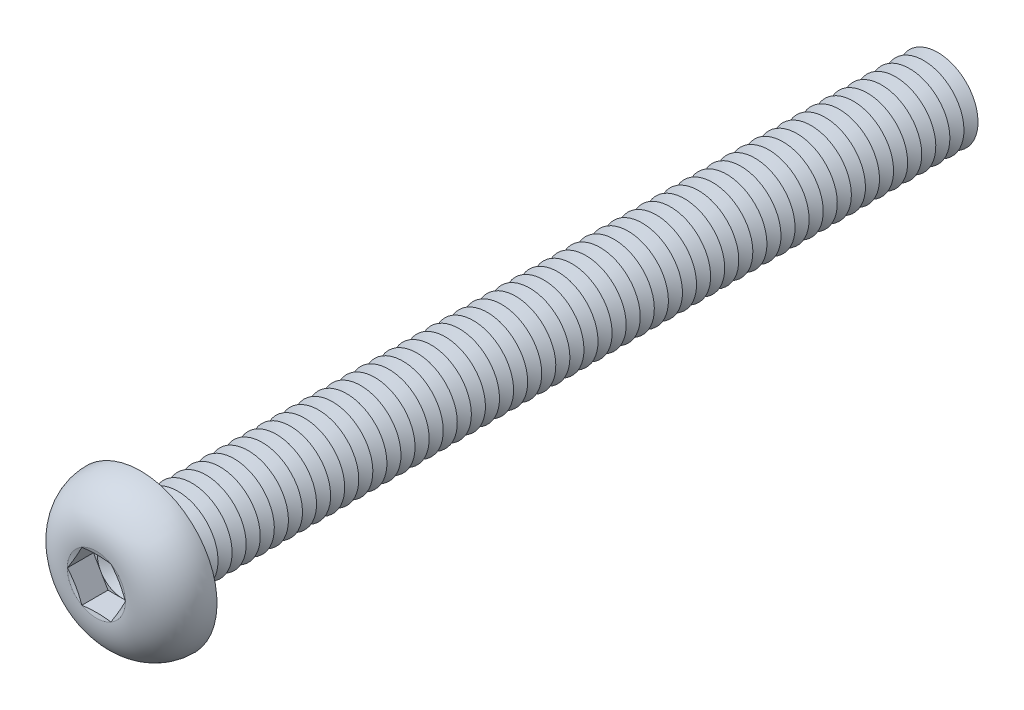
ISO-10303-21;
HEADER;
FILE_DESCRIPTION(('STEP AP214'),'2;1');
FILE_NAME('part.step','',(''),(''),'','','');
FILE_SCHEMA(('AUTOMOTIVE_DESIGN { 1 0 10303 214 1 1 1 1 }'));
ENDSEC;
DATA;
#1=APPLICATION_CONTEXT('core data for automotive mechanical design processes');
#2=APPLICATION_PROTOCOL_DEFINITION('international standard','automotive_design',2000,#1);
#3=PRODUCT_CONTEXT('',#1,'mechanical');
#4=PRODUCT('Part','Part','',(#3));
#5=PRODUCT_RELATED_PRODUCT_CATEGORY('part','',(#4));
#6=PRODUCT_DEFINITION_FORMATION('','',#4);
#7=PRODUCT_DEFINITION_CONTEXT('part definition',#1,'design');
#8=PRODUCT_DEFINITION('design','',#6,#7);
#9=PRODUCT_DEFINITION_SHAPE('','',#8);
#10=(LENGTH_UNIT() NAMED_UNIT(*) SI_UNIT(.MILLI.,.METRE.));
#11=(NAMED_UNIT(*) PLANE_ANGLE_UNIT() SI_UNIT($,.RADIAN.));
#12=(NAMED_UNIT(*) SI_UNIT($,.STERADIAN.) SOLID_ANGLE_UNIT());
#13=UNCERTAINTY_MEASURE_WITH_UNIT(LENGTH_MEASURE(1.E-05),#10,'distance_accuracy_value','');
#14=(GEOMETRIC_REPRESENTATION_CONTEXT(3) GLOBAL_UNCERTAINTY_ASSIGNED_CONTEXT((#13)) GLOBAL_UNIT_ASSIGNED_CONTEXT((#10,
#11,#12)) REPRESENTATION_CONTEXT('',''));
#15=CARTESIAN_POINT('',(0.,0.,0.));
#16=DIRECTION('',(0.,0.,1.));
#17=DIRECTION('',(1.,0.,0.));
#18=AXIS2_PLACEMENT_3D('',#15,#16,#17);
#19=CARTESIAN_POINT('',(0.,0.,0.899999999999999));
#20=DIRECTION('',(0.,0.,1.));
#21=DIRECTION('',(1.,0.,0.));
#22=AXIS2_PLACEMENT_3D('',#19,#20,#21);
#23=PLANE('',#22);
#24=CARTESIAN_POINT('',(0.,0.,0.899999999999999));
#25=DIRECTION('',(0.,0.,1.));
#26=DIRECTION('',(1.,0.,0.));
#27=AXIS2_PLACEMENT_3D('',#24,#25,#26);
#28=CIRCLE('',#27,1.24999941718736);
#29=CARTESIAN_POINT('',(1.08253125,0.624999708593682,0.899999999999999));
#30=VERTEX_POINT('',#29);
#31=CARTESIAN_POINT('',(0.,1.24999941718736,0.899999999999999));
#32=VERTEX_POINT('',#31);
#33=EDGE_CURVE('E118',#30,#32,#28,.T.);
#34=ORIENTED_EDGE('',*,*,#33,.F.);
#35=DIRECTION('',(-0.5,0.866025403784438,0.));
#36=VECTOR('',#35,1.);
#37=CARTESIAN_POINT('',(1.443375,0.,0.899999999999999));
#38=LINE('',#37,#36);
#39=CARTESIAN_POINT('',(0.7216875,1.24999941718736,0.899999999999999));
#40=VERTEX_POINT('',#39);
#41=EDGE_CURVE('E125',#30,#40,#38,.T.);
#42=ORIENTED_EDGE('',*,*,#41,.T.);
#43=DIRECTION('',(-1.,0.,0.));
#44=VECTOR('',#43,1.);
#45=CARTESIAN_POINT('',(0.7216875,1.24999941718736,0.899999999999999));
#46=LINE('',#45,#44);
#47=EDGE_CURVE('E136',#40,#32,#46,.T.);
#48=ORIENTED_EDGE('',*,*,#47,.T.);
#49=EDGE_LOOP('',(#34,#42,#48));
#50=FACE_BOUND('',#49,.T.);
#51=ADVANCED_FACE('F39',(#50),#23,.T.);
#52=CARTESIAN_POINT('',(0.,0.,0.899999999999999));
#53=DIRECTION('',(0.,0.,1.));
#54=DIRECTION('',(1.,0.,0.));
#55=AXIS2_PLACEMENT_3D('',#52,#53,#54);
#56=CIRCLE('',#55,1.24999941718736);
#57=CARTESIAN_POINT('',(-1.08253125,0.624999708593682,0.899999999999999));
#58=VERTEX_POINT('',#57);
#59=EDGE_CURVE('E11',#32,#58,#56,.T.);
#60=ORIENTED_EDGE('',*,*,#59,.F.);
#61=CARTESIAN_POINT('',(-0.721687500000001,1.24999941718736,0.899999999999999));
#62=VERTEX_POINT('',#61);
#63=EDGE_CURVE('E131',#32,#62,#46,.T.);
#64=ORIENTED_EDGE('',*,*,#63,.T.);
#65=DIRECTION('',(-0.5,-0.866025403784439,0.));
#66=VECTOR('',#65,1.);
#67=CARTESIAN_POINT('',(-0.721687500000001,1.24999941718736,0.899999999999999));
#68=LINE('',#67,#66);
#69=EDGE_CURVE('E134',#62,#58,#68,.T.);
#70=ORIENTED_EDGE('',*,*,#69,.T.);
#71=EDGE_LOOP('',(#60,#64,#70));
#72=FACE_BOUND('',#71,.T.);
#73=ADVANCED_FACE('F130',(#72),#23,.T.);
#74=CARTESIAN_POINT('',(-1.08253125,-0.624999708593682,0.899999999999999));
#75=VERTEX_POINT('',#74);
#76=EDGE_CURVE('E49',#58,#75,#56,.T.);
#77=ORIENTED_EDGE('',*,*,#76,.F.);
#78=CARTESIAN_POINT('',(-1.443375,0.,0.899999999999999));
#79=VERTEX_POINT('',#78);
#80=EDGE_CURVE('E143',#58,#79,#68,.T.);
#81=ORIENTED_EDGE('',*,*,#80,.T.);
#82=DIRECTION('',(0.5,-0.866025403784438,0.));
#83=VECTOR('',#82,1.);
#84=CARTESIAN_POINT('',(-1.443375,0.,0.899999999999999));
#85=LINE('',#84,#83);
#86=EDGE_CURVE('E152',#79,#75,#85,.T.);
#87=ORIENTED_EDGE('',*,*,#86,.T.);
#88=EDGE_LOOP('',(#77,#81,#87));
#89=FACE_BOUND('',#88,.T.);
#90=ADVANCED_FACE('F729',(#89),#23,.T.);
#91=CARTESIAN_POINT('',(0.,-1.24999941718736,0.899999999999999));
#92=VERTEX_POINT('',#91);
#93=EDGE_CURVE('E712',#75,#92,#56,.T.);
#94=ORIENTED_EDGE('',*,*,#93,.F.);
#95=CARTESIAN_POINT('',(-0.721687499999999,-1.24999941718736,0.899999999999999));
#96=VERTEX_POINT('',#95);
#97=EDGE_CURVE('E151',#75,#96,#85,.T.);
#98=ORIENTED_EDGE('',*,*,#97,.T.);
#99=DIRECTION('',(1.,0.,0.));
#100=VECTOR('',#99,1.);
#101=CARTESIAN_POINT('',(-0.721687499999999,-1.24999941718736,0.899999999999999));
#102=LINE('',#101,#100);
#103=EDGE_CURVE('E157',#96,#92,#102,.T.);
#104=ORIENTED_EDGE('',*,*,#103,.T.);
#105=EDGE_LOOP('',(#94,#98,#104));
#106=FACE_BOUND('',#105,.T.);
#107=ADVANCED_FACE('F723',(#106),#23,.T.);
#108=CARTESIAN_POINT('',(1.08253125,-0.624999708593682,0.899999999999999));
#109=VERTEX_POINT('',#108);
#110=EDGE_CURVE('E56',#92,#109,#56,.T.);
#111=ORIENTED_EDGE('',*,*,#110,.F.);
#112=CARTESIAN_POINT('',(0.721687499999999,-1.24999941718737,0.899999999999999));
#113=VERTEX_POINT('',#112);
#114=EDGE_CURVE('E156',#92,#113,#102,.T.);
#115=ORIENTED_EDGE('',*,*,#114,.T.);
#116=DIRECTION('',(0.5,0.866025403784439,0.));
#117=VECTOR('',#116,1.);
#118=CARTESIAN_POINT('',(0.721687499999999,-1.24999941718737,0.899999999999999));
#119=LINE('',#118,#117);
#120=EDGE_CURVE('E161',#113,#109,#119,.T.);
#121=ORIENTED_EDGE('',*,*,#120,.T.);
#122=EDGE_LOOP('',(#111,#115,#121));
#123=FACE_BOUND('',#122,.T.);
#124=ADVANCED_FACE('F797',(#123),#23,.T.);
#125=CARTESIAN_POINT('',(0.,0.,2.2));
#126=DIRECTION('',(0.,0.,1.));
#127=DIRECTION('',(0.,-1.,0.));
#128=AXIS2_PLACEMENT_3D('',#125,#126,#127);
#129=CONICAL_SURFACE('',#128,1.443375,1.30899693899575);
#130=CARTESIAN_POINT('',(1.44349047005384,-0.000200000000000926,2.20003094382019));
#131=CARTESIAN_POINT('',(1.41351104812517,0.0517258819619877,2.19199301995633));
#132=CARTESIAN_POINT('',(1.38347725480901,0.103745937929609,2.18469579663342));
#133=CARTESIAN_POINT('',(1.32330355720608,0.20796983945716,2.17187512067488));
#134=CARTESIAN_POINT('',(1.29316361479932,0.260173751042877,2.16635238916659));
#135=CARTESIAN_POINT('',(1.23296043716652,0.364448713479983,2.15740323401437));
#136=CARTESIAN_POINT('',(1.20289760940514,0.416519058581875,2.15396613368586));
#137=CARTESIAN_POINT('',(1.14273359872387,0.520726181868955,2.14935732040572));
#138=CARTESIAN_POINT('',(1.11263242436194,0.572862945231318,2.14818516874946));
#139=CARTESIAN_POINT('',(1.05243007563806,0.677136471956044,2.14818516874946));
#140=CARTESIAN_POINT('',(1.02232890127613,0.729273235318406,2.14935732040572));
#141=CARTESIAN_POINT('',(0.962164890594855,0.833480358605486,2.15396613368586));
#142=CARTESIAN_POINT('',(0.932102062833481,0.885550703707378,2.15740323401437));
#143=CARTESIAN_POINT('',(0.87189888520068,0.989825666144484,2.16635238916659));
#144=CARTESIAN_POINT('',(0.841758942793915,1.0420295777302,2.17187512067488));
#145=CARTESIAN_POINT('',(0.78158524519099,1.14625347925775,2.18469579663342));
#146=CARTESIAN_POINT('',(0.751551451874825,1.19827353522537,2.19199301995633));
#147=CARTESIAN_POINT('',(0.721572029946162,1.25019941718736,2.20003094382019));
#148=B_SPLINE_CURVE_WITH_KNOTS('',3,(#130,#131,#132,#133,#134,#135,#136,#137,#138,#139,#140,
#141,#142,#143,#144,#145,#146,#147),.UNSPECIFIED.,.F.,.F.,(4,2,2,2,2,2,2,2,4),(0.,
0.181495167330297,0.363063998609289,0.543695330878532,0.724291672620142,0.904888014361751,
1.08551934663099,1.26708817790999,1.44858334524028),.UNSPECIFIED.);
#149=CARTESIAN_POINT('',(1.443375,0.,2.2));
#150=VERTEX_POINT('',#149);
#151=CARTESIAN_POINT('',(0.72168750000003,1.24999941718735,2.2));
#152=VERTEX_POINT('',#151);
#153=EDGE_CURVE('E221',#150,#152,#148,.T.);
#154=ORIENTED_EDGE('',*,*,#153,.F.);
#155=CARTESIAN_POINT('',(0.,0.,2.2));
#156=DIRECTION('',(0.,0.,-1.));
#157=DIRECTION('',(0.,1.,0.));
#158=AXIS2_PLACEMENT_3D('',#155,#156,#157);
#159=CIRCLE('',#158,1.443375);
#160=EDGE_CURVE('E692',#152,#150,#159,.T.);
#161=ORIENTED_EDGE('',*,*,#160,.F.);
#162=EDGE_LOOP('',(#154,#161));
#163=FACE_BOUND('',#162,.T.);
#164=ADVANCED_FACE('F801',(#163),#129,.F.);
#165=CARTESIAN_POINT('',(0.721572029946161,-1.25019941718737,2.20003094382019));
#166=CARTESIAN_POINT('',(0.751551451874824,-1.19827353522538,2.19199301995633));
#167=CARTESIAN_POINT('',(0.78158524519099,-1.14625347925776,2.18469579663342));
#168=CARTESIAN_POINT('',(0.841758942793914,-1.0420295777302,2.17187512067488));
#169=CARTESIAN_POINT('',(0.871898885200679,-0.989825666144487,2.16635238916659));
#170=CARTESIAN_POINT('',(0.932102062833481,-0.885550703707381,2.15740323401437));
#171=CARTESIAN_POINT('',(0.962164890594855,-0.833480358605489,2.15396613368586));
#172=CARTESIAN_POINT('',(1.02232890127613,-0.729273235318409,2.14935732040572));
#173=CARTESIAN_POINT('',(1.05243007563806,-0.677136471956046,2.14818516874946));
#174=CARTESIAN_POINT('',(1.11263242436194,-0.57286294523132,2.14818516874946));
#175=CARTESIAN_POINT('',(1.14273359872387,-0.520726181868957,2.14935732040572));
#176=CARTESIAN_POINT('',(1.20289760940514,-0.416519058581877,2.15396613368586));
#177=CARTESIAN_POINT('',(1.23296043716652,-0.364448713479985,2.15740323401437));
#178=CARTESIAN_POINT('',(1.29316361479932,-0.260173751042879,2.16635238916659));
#179=CARTESIAN_POINT('',(1.32330355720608,-0.207969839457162,2.17187512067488));
#180=CARTESIAN_POINT('',(1.38347725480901,-0.103745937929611,2.18469579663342));
#181=CARTESIAN_POINT('',(1.41351104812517,-0.0517258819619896,2.19199301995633));
#182=CARTESIAN_POINT('',(1.44349047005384,0.00019999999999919,2.20003094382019));
#183=B_SPLINE_CURVE_WITH_KNOTS('',3,(#165,#166,#167,#168,#169,#170,#171,#172,#173,#174,#175,
#176,#177,#178,#179,#180,#181,#182),.UNSPECIFIED.,.F.,.F.,(4,2,2,2,2,2,2,2,4),(0.,
0.181495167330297,0.363063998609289,0.543695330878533,0.724291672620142,0.904888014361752,
1.085519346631,1.26708817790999,1.44858334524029),.UNSPECIFIED.);
#184=CARTESIAN_POINT('',(0.721687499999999,-1.24999941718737,2.2));
#185=VERTEX_POINT('',#184);
#186=EDGE_CURVE('E230',#185,#150,#183,.T.);
#187=ORIENTED_EDGE('',*,*,#186,.F.);
#188=EDGE_CURVE('E697',#150,#185,#159,.T.);
#189=ORIENTED_EDGE('',*,*,#188,.F.);
#190=EDGE_LOOP('',(#187,#189));
#191=FACE_BOUND('',#190,.T.);
#192=ADVANCED_FACE('F763',(#191),#129,.F.);
#193=CARTESIAN_POINT('',(-2.17815859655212,-1.24999941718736,2.48616275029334));
#194=CARTESIAN_POINT('',(-2.07269794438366,-1.24999941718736,2.46168811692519));
#195=CARTESIAN_POINT('',(-1.96714913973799,-1.24999941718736,2.43756889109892));
#196=CARTESIAN_POINT('',(-1.75576352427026,-1.24999941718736,2.39052699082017));
#197=CARTESIAN_POINT('',(-1.64992665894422,-1.24999941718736,2.36760456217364));
#198=CARTESIAN_POINT('',(-1.43690237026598,-1.24999941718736,2.3232454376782));
#199=CARTESIAN_POINT('',(-1.32971158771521,-1.24999941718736,2.30182468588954));
#200=CARTESIAN_POINT('',(-1.1148274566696,-1.24999941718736,2.26156703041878));
#201=CARTESIAN_POINT('',(-1.00713406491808,-1.24999941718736,2.24273035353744));
#202=CARTESIAN_POINT('',(-0.794044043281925,-1.24999941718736,2.2093913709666));
#203=CARTESIAN_POINT('',(-0.688664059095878,-1.24999941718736,2.19478562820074));
#204=CARTESIAN_POINT('',(-0.477310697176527,-1.24999941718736,2.17085809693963));
#205=CARTESIAN_POINT('',(-0.371337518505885,-1.24999941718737,2.16153463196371));
#206=CARTESIAN_POINT('',(-0.159455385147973,-1.24999941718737,2.14976770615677));
#207=CARTESIAN_POINT('',(-0.0535482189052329,-1.24999941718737,2.14729400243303));
#208=CARTESIAN_POINT('',(0.158189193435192,-1.24999941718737,2.14966287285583));
#209=CARTESIAN_POINT('',(0.264019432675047,-1.24999941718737,2.15450603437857));
#210=CARTESIAN_POINT('',(0.445148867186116,-1.24999941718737,2.16825380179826));
#211=CARTESIAN_POINT('',(0.520574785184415,-1.24999941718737,2.17561242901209));
#212=CARTESIAN_POINT('',(0.671115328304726,-1.24999941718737,2.19297000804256));
#213=CARTESIAN_POINT('',(0.746229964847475,-1.24999941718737,2.20296886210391));
#214=CARTESIAN_POINT('',(0.896387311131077,-1.24999941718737,2.22505910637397));
#215=CARTESIAN_POINT('',(0.971429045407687,-1.24999941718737,2.23715700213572));
#216=CARTESIAN_POINT('',(1.12124320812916,-1.24999941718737,2.26292371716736));
#217=CARTESIAN_POINT('',(1.19601562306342,-1.24999941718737,2.27659261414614));
#218=CARTESIAN_POINT('',(1.34686913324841,-1.24999941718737,2.30540811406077));
#219=CARTESIAN_POINT('',(1.42294548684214,-1.24999941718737,2.32057934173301));
#220=CARTESIAN_POINT('',(1.57490676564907,-1.24999941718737,2.351851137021));
#221=CARTESIAN_POINT('',(1.65079168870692,-1.24999941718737,2.36795171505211));
#222=CARTESIAN_POINT('',(1.80199501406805,-1.24999941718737,2.40076814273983));
#223=CARTESIAN_POINT('',(1.87731425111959,-1.24999941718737,2.41748016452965));
#224=CARTESIAN_POINT('',(2.02782424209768,-1.24999941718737,2.45144971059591));
#225=CARTESIAN_POINT('',(2.10301500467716,-1.24999941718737,2.46870719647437));
#226=CARTESIAN_POINT('',(2.17815859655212,-1.24999941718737,2.48616275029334));
#227=B_SPLINE_CURVE_WITH_KNOTS('',3,(#193,#194,#195,#196,#197,#198,#199,#200,#201,#202,#203,
#204,#205,#206,#207,#208,#209,#210,#211,#212,#213,#214,#215,#216,#217,#218,#219,#220,#221,#222,
#223,#224,#225,#226),.UNSPECIFIED.,.F.,.F.,(4,2,2,2,2,2,2,2,2,2,2,2,2,2,2,2,4),(0.,
0.324797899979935,0.649662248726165,0.977572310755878,1.30551113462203,1.62458166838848,
1.94355087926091,2.26110952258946,2.57869365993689,2.80599541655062,3.03328875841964,
3.26129956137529,3.48932164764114,3.7220371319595,3.95475522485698,4.18620606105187,
4.41764064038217),.UNSPECIFIED.);
#228=CARTESIAN_POINT('',(-0.721687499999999,-1.24999941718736,2.2));
#229=VERTEX_POINT('',#228);
#230=EDGE_CURVE('E742',#229,#185,#227,.T.);
#231=ORIENTED_EDGE('',*,*,#230,.F.);
#232=EDGE_CURVE('E755',#185,#229,#159,.T.);
#233=ORIENTED_EDGE('',*,*,#232,.F.);
#234=EDGE_LOOP('',(#231,#233));
#235=FACE_BOUND('',#234,.T.);
#236=ADVANCED_FACE('F768',(#235),#129,.F.);
#237=CARTESIAN_POINT('',(-1.44349047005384,0.000199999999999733,2.20003094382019));
#238=CARTESIAN_POINT('',(-1.41351104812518,-0.051725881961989,2.19199301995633));
#239=CARTESIAN_POINT('',(-1.38347725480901,-0.103745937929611,2.18469579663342));
#240=CARTESIAN_POINT('',(-1.32330355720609,-0.207969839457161,2.17187512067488));
#241=CARTESIAN_POINT('',(-1.29316361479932,-0.260173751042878,2.16635238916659));
#242=CARTESIAN_POINT('',(-1.23296043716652,-0.364448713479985,2.15740323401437));
#243=CARTESIAN_POINT('',(-1.20289760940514,-0.416519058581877,2.15396613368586));
#244=CARTESIAN_POINT('',(-1.14273359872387,-0.520726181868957,2.14935732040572));
#245=CARTESIAN_POINT('',(-1.11263242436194,-0.57286294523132,2.14818516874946));
#246=CARTESIAN_POINT('',(-1.05243007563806,-0.677136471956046,2.14818516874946));
#247=CARTESIAN_POINT('',(-1.02232890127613,-0.729273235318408,2.14935732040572));
#248=CARTESIAN_POINT('',(-0.962164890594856,-0.833480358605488,2.15396613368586));
#249=CARTESIAN_POINT('',(-0.932102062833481,-0.885550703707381,2.15740323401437));
#250=CARTESIAN_POINT('',(-0.87189888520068,-0.989825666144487,2.16635238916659));
#251=CARTESIAN_POINT('',(-0.841758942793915,-1.0420295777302,2.17187512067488));
#252=CARTESIAN_POINT('',(-0.78158524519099,-1.14625347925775,2.18469579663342));
#253=CARTESIAN_POINT('',(-0.751551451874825,-1.19827353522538,2.19199301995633));
#254=CARTESIAN_POINT('',(-0.721572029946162,-1.25019941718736,2.20003094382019));
#255=B_SPLINE_CURVE_WITH_KNOTS('',3,(#237,#238,#239,#240,#241,#242,#243,#244,#245,#246,#247,
#248,#249,#250,#251,#252,#253,#254),.UNSPECIFIED.,.F.,.F.,(4,2,2,2,2,2,2,2,4),(0.,
0.181495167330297,0.36306399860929,0.543695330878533,0.724291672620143,0.904888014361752,
1.085519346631,1.26708817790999,1.44858334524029),.UNSPECIFIED.);
#256=CARTESIAN_POINT('',(-1.443375,0.,2.2));
#257=VERTEX_POINT('',#256);
#258=EDGE_CURVE('E734',#257,#229,#255,.T.);
#259=ORIENTED_EDGE('',*,*,#258,.F.);
#260=EDGE_CURVE('E740',#229,#257,#159,.T.);
#261=ORIENTED_EDGE('',*,*,#260,.F.);
#262=EDGE_LOOP('',(#259,#261));
#263=FACE_BOUND('',#262,.T.);
#264=ADVANCED_FACE('F738',(#263),#129,.F.);
#265=CARTESIAN_POINT('',(-0.721572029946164,1.25019941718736,2.20003094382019));
#266=CARTESIAN_POINT('',(-0.751551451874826,1.19827353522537,2.19199301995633));
#267=CARTESIAN_POINT('',(-0.781585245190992,1.14625347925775,2.18469579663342));
#268=CARTESIAN_POINT('',(-0.841758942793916,1.0420295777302,2.17187512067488));
#269=CARTESIAN_POINT('',(-0.871898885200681,0.989825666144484,2.16635238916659));
#270=CARTESIAN_POINT('',(-0.932102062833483,0.885550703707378,2.15740323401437));
#271=CARTESIAN_POINT('',(-0.962164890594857,0.833480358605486,2.15396613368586));
#272=CARTESIAN_POINT('',(-1.02232890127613,0.729273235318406,2.14935732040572));
#273=CARTESIAN_POINT('',(-1.05243007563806,0.677136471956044,2.14818516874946));
#274=CARTESIAN_POINT('',(-1.11263242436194,0.572862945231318,2.14818516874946));
#275=CARTESIAN_POINT('',(-1.14273359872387,0.520726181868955,2.14935732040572));
#276=CARTESIAN_POINT('',(-1.20289760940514,0.416519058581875,2.15396613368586));
#277=CARTESIAN_POINT('',(-1.23296043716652,0.364448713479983,2.15740323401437));
#278=CARTESIAN_POINT('',(-1.29316361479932,0.260173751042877,2.16635238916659));
#279=CARTESIAN_POINT('',(-1.32330355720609,0.20796983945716,2.17187512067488));
#280=CARTESIAN_POINT('',(-1.38347725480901,0.10374593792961,2.18469579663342));
#281=CARTESIAN_POINT('',(-1.41351104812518,0.0517258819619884,2.19199301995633));
#282=CARTESIAN_POINT('',(-1.44349047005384,-0.000200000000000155,2.20003094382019));
#283=B_SPLINE_CURVE_WITH_KNOTS('',3,(#265,#266,#267,#268,#269,#270,#271,#272,#273,#274,#275,
#276,#277,#278,#279,#280,#281,#282),.UNSPECIFIED.,.F.,.F.,(4,2,2,2,2,2,2,2,4),(0.,
0.181495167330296,0.363063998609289,0.543695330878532,0.724291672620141,0.90488801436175,
1.08551934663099,1.26708817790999,1.44858334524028),.UNSPECIFIED.);
#284=CARTESIAN_POINT('',(-0.721687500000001,1.24999941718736,2.2));
#285=VERTEX_POINT('',#284);
#286=EDGE_CURVE('E194',#285,#257,#283,.T.);
#287=ORIENTED_EDGE('',*,*,#286,.F.);
#288=EDGE_CURVE('E745',#257,#285,#159,.T.);
#289=ORIENTED_EDGE('',*,*,#288,.F.);
#290=EDGE_LOOP('',(#287,#289));
#291=FACE_BOUND('',#290,.T.);
#292=ADVANCED_FACE('F746',(#291),#129,.F.);
#293=CARTESIAN_POINT('',(0.,0.,-37.55));
#294=DIRECTION('',(0.,0.,1.));
#295=DIRECTION('',(0.,-1.,0.));
#296=AXIS2_PLACEMENT_3D('',#293,#294,#295);
#297=CONICAL_SURFACE('',#296,1.99999999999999,1.04719755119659);
#298=CARTESIAN_POINT('',(0.,0.,-37.9));
#299=DIRECTION('',(0.,0.,1.));
#300=DIRECTION('',(0.,-1.,0.));
#301=AXIS2_PLACEMENT_3D('',#298,#299,#300);
#302=CIRCLE('',#301,1.39378221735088);
#303=CARTESIAN_POINT('',(0.,-1.39378221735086,-37.9));
#304=VERTEX_POINT('',#303);
#305=EDGE_CURVE('E663',#304,#304,#302,.T.);
#306=ORIENTED_EDGE('',*,*,#305,.T.);
#307=EDGE_LOOP('',(#306));
#308=FACE_BOUND('',#307,.T.);
#309=CARTESIAN_POINT('',(0.,0.,-37.55));
#310=DIRECTION('',(0.,0.,1.));
#311=DIRECTION('',(0.,-1.,0.));
#312=AXIS2_PLACEMENT_3D('',#309,#310,#311);
#313=CIRCLE('',#312,1.99999999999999);
#314=CARTESIAN_POINT('',(0.,-1.99999999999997,-37.55));
#315=VERTEX_POINT('',#314);
#316=EDGE_CURVE('E659',#315,#315,#313,.T.);
#317=ORIENTED_EDGE('',*,*,#316,.F.);
#318=EDGE_LOOP('',(#317));
#319=FACE_BOUND('',#318,.T.);
#320=ADVANCED_FACE('F830',(#308,#319),#297,.T.);
#321=CARTESIAN_POINT('',(0.,0.,-37.9));
#322=DIRECTION('',(0.,0.,-1.));
#323=DIRECTION('',(0.,1.,0.));
#324=AXIS2_PLACEMENT_3D('',#321,#322,#323);
#325=CONICAL_SURFACE('',#324,1.39378221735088,1.0471975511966);
#326=CARTESIAN_POINT('',(0.,0.,-38.25));
#327=DIRECTION('',(0.,0.,1.));
#328=DIRECTION('',(0.,-1.,0.));
#329=AXIS2_PLACEMENT_3D('',#326,#327,#328);
#330=CIRCLE('',#329,1.99999999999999);
#331=CARTESIAN_POINT('',(0.,-1.99999999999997,-38.25));
#332=VERTEX_POINT('',#331);
#333=EDGE_CURVE('E667',#332,#332,#330,.T.);
#334=ORIENTED_EDGE('',*,*,#333,.T.);
#335=EDGE_LOOP('',(#334));
#336=FACE_BOUND('',#335,.T.);
#337=ORIENTED_EDGE('',*,*,#305,.F.);
#338=EDGE_LOOP('',(#337));
#339=FACE_BOUND('',#338,.T.);
#340=ADVANCED_FACE('F835',(#336,#339),#325,.T.);
#341=CARTESIAN_POINT('',(0.,2.,-40.));
#342=DIRECTION('',(0.,0.,-1.));
#343=DIRECTION('',(0.,1.,0.));
#344=AXIS2_PLACEMENT_3D('',#341,#342,#343);
#345=PLANE('',#344);
#346=CARTESIAN_POINT('',(0.,0.,-40.));
#347=DIRECTION('',(0.,0.,1.));
#348=DIRECTION('',(0.,-1.,0.));
#349=AXIS2_PLACEMENT_3D('',#346,#347,#348);
#350=CIRCLE('',#349,1.39378221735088);
#351=CARTESIAN_POINT('',(0.,-1.39378221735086,-40.));
#352=VERTEX_POINT('',#351);
#353=EDGE_CURVE('E687',#352,#352,#350,.T.);
#354=ORIENTED_EDGE('',*,*,#353,.F.);
#355=EDGE_LOOP('',(#354));
#356=FACE_BOUND('',#355,.T.);
#357=ADVANCED_FACE('F1010',(#356),#345,.T.);
#358=CARTESIAN_POINT('',(0.,0.,-39.65));
#359=DIRECTION('',(0.,0.,1.));
#360=DIRECTION('',(0.,-1.,0.));
#361=AXIS2_PLACEMENT_3D('',#358,#359,#360);
#362=CONICAL_SURFACE('',#361,1.99999999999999,1.04719755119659);
#363=ORIENTED_EDGE('',*,*,#353,.T.);
#364=EDGE_LOOP('',(#363));
#365=FACE_BOUND('',#364,.T.);
#366=CARTESIAN_POINT('',(0.,0.,-39.65));
#367=DIRECTION('',(0.,0.,1.));
#368=DIRECTION('',(0.,-1.,0.));
#369=AXIS2_PLACEMENT_3D('',#366,#367,#368);
#370=CIRCLE('',#369,1.99999999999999);
#371=CARTESIAN_POINT('',(0.,-1.99999999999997,-39.65));
#372=VERTEX_POINT('',#371);
#373=EDGE_CURVE('E683',#372,#372,#370,.T.);
#374=ORIENTED_EDGE('',*,*,#373,.F.);
#375=EDGE_LOOP('',(#374));
#376=FACE_BOUND('',#375,.T.);
#377=ADVANCED_FACE('F1003',(#365,#376),#362,.T.);
#378=CARTESIAN_POINT('',(0.,0.,-39.3));
#379=DIRECTION('',(0.,0.,-1.));
#380=DIRECTION('',(0.,1.,0.));
#381=AXIS2_PLACEMENT_3D('',#378,#379,#380);
#382=CONICAL_SURFACE('',#381,1.39378221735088,1.0471975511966);
#383=ORIENTED_EDGE('',*,*,#373,.T.);
#384=EDGE_LOOP('',(#383));
#385=FACE_BOUND('',#384,.T.);
#386=CARTESIAN_POINT('',(0.,0.,-39.3));
#387=DIRECTION('',(0.,0.,1.));
#388=DIRECTION('',(0.,-1.,0.));
#389=AXIS2_PLACEMENT_3D('',#386,#387,#388);
#390=CIRCLE('',#389,1.39378221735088);
#391=CARTESIAN_POINT('',(0.,-1.39378221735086,-39.3));
#392=VERTEX_POINT('',#391);
#393=EDGE_CURVE('E679',#392,#392,#390,.T.);
#394=ORIENTED_EDGE('',*,*,#393,.F.);
#395=EDGE_LOOP('',(#394));
#396=FACE_BOUND('',#395,.T.);
#397=ADVANCED_FACE('F1009',(#385,#396),#382,.T.);
#398=CARTESIAN_POINT('',(0.,0.,-38.95));
#399=DIRECTION('',(0.,0.,1.));
#400=DIRECTION('',(0.,-1.,0.));
#401=AXIS2_PLACEMENT_3D('',#398,#399,#400);
#402=CONICAL_SURFACE('',#401,1.99999999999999,1.04719755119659);
#403=ORIENTED_EDGE('',*,*,#393,.T.);
#404=EDGE_LOOP('',(#403));
#405=FACE_BOUND('',#404,.T.);
#406=CARTESIAN_POINT('',(0.,0.,-38.95));
#407=DIRECTION('',(0.,0.,1.));
#408=DIRECTION('',(0.,-1.,0.));
#409=AXIS2_PLACEMENT_3D('',#406,#407,#408);
#410=CIRCLE('',#409,1.99999999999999);
#411=CARTESIAN_POINT('',(0.,-1.99999999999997,-38.95));
#412=VERTEX_POINT('',#411);
#413=EDGE_CURVE('E675',#412,#412,#410,.T.);
#414=ORIENTED_EDGE('',*,*,#413,.F.);
#415=EDGE_LOOP('',(#414));
#416=FACE_BOUND('',#415,.T.);
#417=ADVANCED_FACE('F1041',(#405,#416),#402,.T.);
#418=CARTESIAN_POINT('',(0.,0.,-38.6));
#419=DIRECTION('',(0.,0.,-1.));
#420=DIRECTION('',(0.,1.,0.));
#421=AXIS2_PLACEMENT_3D('',#418,#419,#420);
#422=CONICAL_SURFACE('',#421,1.39378221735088,1.0471975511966);
#423=ORIENTED_EDGE('',*,*,#413,.T.);
#424=EDGE_LOOP('',(#423));
#425=FACE_BOUND('',#424,.T.);
#426=CARTESIAN_POINT('',(0.,0.,-38.6));
#427=DIRECTION('',(0.,0.,1.));
#428=DIRECTION('',(0.,-1.,0.));
#429=AXIS2_PLACEMENT_3D('',#426,#427,#428);
#430=CIRCLE('',#429,1.39378221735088);
#431=CARTESIAN_POINT('',(0.,-1.39378221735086,-38.6));
#432=VERTEX_POINT('',#431);
#433=EDGE_CURVE('E671',#432,#432,#430,.T.);
#434=ORIENTED_EDGE('',*,*,#433,.F.);
#435=EDGE_LOOP('',(#434));
#436=FACE_BOUND('',#435,.T.);
#437=ADVANCED_FACE('F1051',(#425,#436),#422,.T.);
#438=CARTESIAN_POINT('',(0.,0.,-38.25));
#439=DIRECTION('',(0.,0.,1.));
#440=DIRECTION('',(0.,-1.,0.));
#441=AXIS2_PLACEMENT_3D('',#438,#439,#440);
#442=CONICAL_SURFACE('',#441,1.99999999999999,1.04719755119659);
#443=ORIENTED_EDGE('',*,*,#433,.T.);
#444=EDGE_LOOP('',(#443));
#445=FACE_BOUND('',#444,.T.);
#446=ORIENTED_EDGE('',*,*,#333,.F.);
#447=EDGE_LOOP('',(#446));
#448=FACE_BOUND('',#447,.T.);
#449=ADVANCED_FACE('F1061',(#445,#448),#442,.T.);
#450=CARTESIAN_POINT('',(0.,0.,-36.85));
#451=DIRECTION('',(0.,0.,1.));
#452=DIRECTION('',(0.,-1.,0.));
#453=AXIS2_PLACEMENT_3D('',#450,#451,#452);
#454=CONICAL_SURFACE('',#453,1.99999999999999,1.04719755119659);
#455=CARTESIAN_POINT('',(0.,0.,-37.2));
#456=DIRECTION('',(0.,0.,1.));
#457=DIRECTION('',(0.,-1.,0.));
#458=AXIS2_PLACEMENT_3D('',#455,#456,#457);
#459=CIRCLE('',#458,1.39378221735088);
#460=CARTESIAN_POINT('',(0.,-1.39378221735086,-37.2));
#461=VERTEX_POINT('',#460);
#462=EDGE_CURVE('E655',#461,#461,#459,.T.);
#463=ORIENTED_EDGE('',*,*,#462,.T.);
#464=EDGE_LOOP('',(#463));
#465=FACE_BOUND('',#464,.T.);
#466=CARTESIAN_POINT('',(0.,0.,-36.85));
#467=DIRECTION('',(0.,0.,1.));
#468=DIRECTION('',(0.,-1.,0.));
#469=AXIS2_PLACEMENT_3D('',#466,#467,#468);
#470=CIRCLE('',#469,1.99999999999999);
#471=CARTESIAN_POINT('',(0.,-1.99999999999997,-36.85));
#472=VERTEX_POINT('',#471);
#473=EDGE_CURVE('E651',#472,#472,#470,.T.);
#474=ORIENTED_EDGE('',*,*,#473,.F.);
#475=EDGE_LOOP('',(#474));
#476=FACE_BOUND('',#475,.T.);
#477=ADVANCED_FACE('F1071',(#465,#476),#454,.T.);
#478=CARTESIAN_POINT('',(0.,0.,-37.2));
#479=DIRECTION('',(0.,0.,-1.));
#480=DIRECTION('',(0.,1.,0.));
#481=AXIS2_PLACEMENT_3D('',#478,#479,#480);
#482=CONICAL_SURFACE('',#481,1.39378221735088,1.0471975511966);
#483=ORIENTED_EDGE('',*,*,#316,.T.);
#484=EDGE_LOOP('',(#483));
#485=FACE_BOUND('',#484,.T.);
#486=ORIENTED_EDGE('',*,*,#462,.F.);
#487=EDGE_LOOP('',(#486));
#488=FACE_BOUND('',#487,.T.);
#489=ADVANCED_FACE('F1081',(#485,#488),#482,.T.);
#490=CARTESIAN_POINT('',(0.,0.,-36.15));
#491=DIRECTION('',(0.,0.,1.));
#492=DIRECTION('',(0.,-1.,0.));
#493=AXIS2_PLACEMENT_3D('',#490,#491,#492);
#494=CONICAL_SURFACE('',#493,1.99999999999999,1.04719755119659);
#495=CARTESIAN_POINT('',(0.,0.,-36.5));
#496=DIRECTION('',(0.,0.,1.));
#497=DIRECTION('',(0.,-1.,0.));
#498=AXIS2_PLACEMENT_3D('',#495,#496,#497);
#499=CIRCLE('',#498,1.39378221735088);
#500=CARTESIAN_POINT('',(0.,-1.39378221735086,-36.5));
#501=VERTEX_POINT('',#500);
#502=EDGE_CURVE('E647',#501,#501,#499,.T.);
#503=ORIENTED_EDGE('',*,*,#502,.T.);
#504=EDGE_LOOP('',(#503));
#505=FACE_BOUND('',#504,.T.);
#506=CARTESIAN_POINT('',(0.,0.,-36.15));
#507=DIRECTION('',(0.,0.,1.));
#508=DIRECTION('',(0.,-1.,0.));
#509=AXIS2_PLACEMENT_3D('',#506,#507,#508);
#510=CIRCLE('',#509,1.99999999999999);
#511=CARTESIAN_POINT('',(0.,-1.99999999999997,-36.15));
#512=VERTEX_POINT('',#511);
#513=EDGE_CURVE('E643',#512,#512,#510,.T.);
#514=ORIENTED_EDGE('',*,*,#513,.F.);
#515=EDGE_LOOP('',(#514));
#516=FACE_BOUND('',#515,.T.);
#517=ADVANCED_FACE('F1091',(#505,#516),#494,.T.);
#518=CARTESIAN_POINT('',(0.,0.,-36.5));
#519=DIRECTION('',(0.,0.,-1.));
#520=DIRECTION('',(0.,1.,0.));
#521=AXIS2_PLACEMENT_3D('',#518,#519,#520);
#522=CONICAL_SURFACE('',#521,1.39378221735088,1.0471975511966);
#523=ORIENTED_EDGE('',*,*,#473,.T.);
#524=EDGE_LOOP('',(#523));
#525=FACE_BOUND('',#524,.T.);
#526=ORIENTED_EDGE('',*,*,#502,.F.);
#527=EDGE_LOOP('',(#526));
#528=FACE_BOUND('',#527,.T.);
#529=ADVANCED_FACE('F1101',(#525,#528),#522,.T.);
#530=CARTESIAN_POINT('',(0.,0.,-35.45));
#531=DIRECTION('',(0.,0.,1.));
#532=DIRECTION('',(0.,-1.,0.));
#533=AXIS2_PLACEMENT_3D('',#530,#531,#532);
#534=CONICAL_SURFACE('',#533,1.99999999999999,1.04719755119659);
#535=CARTESIAN_POINT('',(0.,0.,-35.8));
#536=DIRECTION('',(0.,0.,1.));
#537=DIRECTION('',(0.,-1.,0.));
#538=AXIS2_PLACEMENT_3D('',#535,#536,#537);
#539=CIRCLE('',#538,1.39378221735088);
#540=CARTESIAN_POINT('',(0.,-1.39378221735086,-35.8));
#541=VERTEX_POINT('',#540);
#542=EDGE_CURVE('E639',#541,#541,#539,.T.);
#543=ORIENTED_EDGE('',*,*,#542,.T.);
#544=EDGE_LOOP('',(#543));
#545=FACE_BOUND('',#544,.T.);
#546=CARTESIAN_POINT('',(0.,0.,-35.45));
#547=DIRECTION('',(0.,0.,1.));
#548=DIRECTION('',(0.,-1.,0.));
#549=AXIS2_PLACEMENT_3D('',#546,#547,#548);
#550=CIRCLE('',#549,1.99999999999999);
#551=CARTESIAN_POINT('',(0.,-1.99999999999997,-35.45));
#552=VERTEX_POINT('',#551);
#553=EDGE_CURVE('E635',#552,#552,#550,.T.);
#554=ORIENTED_EDGE('',*,*,#553,.F.);
#555=EDGE_LOOP('',(#554));
#556=FACE_BOUND('',#555,.T.);
#557=ADVANCED_FACE('F1111',(#545,#556),#534,.T.);
#558=CARTESIAN_POINT('',(0.,0.,-35.8));
#559=DIRECTION('',(0.,0.,-1.));
#560=DIRECTION('',(0.,1.,0.));
#561=AXIS2_PLACEMENT_3D('',#558,#559,#560);
#562=CONICAL_SURFACE('',#561,1.39378221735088,1.0471975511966);
#563=ORIENTED_EDGE('',*,*,#513,.T.);
#564=EDGE_LOOP('',(#563));
#565=FACE_BOUND('',#564,.T.);
#566=ORIENTED_EDGE('',*,*,#542,.F.);
#567=EDGE_LOOP('',(#566));
#568=FACE_BOUND('',#567,.T.);
#569=ADVANCED_FACE('F1121',(#565,#568),#562,.T.);
#570=CARTESIAN_POINT('',(0.,0.,-34.75));
#571=DIRECTION('',(0.,0.,1.));
#572=DIRECTION('',(0.,-1.,0.));
#573=AXIS2_PLACEMENT_3D('',#570,#571,#572);
#574=CONICAL_SURFACE('',#573,1.99999999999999,1.04719755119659);
#575=CARTESIAN_POINT('',(0.,0.,-35.1));
#576=DIRECTION('',(0.,0.,1.));
#577=DIRECTION('',(0.,-1.,0.));
#578=AXIS2_PLACEMENT_3D('',#575,#576,#577);
#579=CIRCLE('',#578,1.39378221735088);
#580=CARTESIAN_POINT('',(0.,-1.39378221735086,-35.1));
#581=VERTEX_POINT('',#580);
#582=EDGE_CURVE('E631',#581,#581,#579,.T.);
#583=ORIENTED_EDGE('',*,*,#582,.T.);
#584=EDGE_LOOP('',(#583));
#585=FACE_BOUND('',#584,.T.);
#586=CARTESIAN_POINT('',(0.,0.,-34.75));
#587=DIRECTION('',(0.,0.,1.));
#588=DIRECTION('',(0.,-1.,0.));
#589=AXIS2_PLACEMENT_3D('',#586,#587,#588);
#590=CIRCLE('',#589,1.99999999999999);
#591=CARTESIAN_POINT('',(0.,-1.99999999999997,-34.75));
#592=VERTEX_POINT('',#591);
#593=EDGE_CURVE('E627',#592,#592,#590,.T.);
#594=ORIENTED_EDGE('',*,*,#593,.F.);
#595=EDGE_LOOP('',(#594));
#596=FACE_BOUND('',#595,.T.);
#597=ADVANCED_FACE('F1131',(#585,#596),#574,.T.);
#598=CARTESIAN_POINT('',(0.,0.,-35.1));
#599=DIRECTION('',(0.,0.,-1.));
#600=DIRECTION('',(0.,1.,0.));
#601=AXIS2_PLACEMENT_3D('',#598,#599,#600);
#602=CONICAL_SURFACE('',#601,1.39378221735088,1.0471975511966);
#603=ORIENTED_EDGE('',*,*,#553,.T.);
#604=EDGE_LOOP('',(#603));
#605=FACE_BOUND('',#604,.T.);
#606=ORIENTED_EDGE('',*,*,#582,.F.);
#607=EDGE_LOOP('',(#606));
#608=FACE_BOUND('',#607,.T.);
#609=ADVANCED_FACE('F1141',(#605,#608),#602,.T.);
#610=CARTESIAN_POINT('',(0.,0.,-34.05));
#611=DIRECTION('',(0.,0.,1.));
#612=DIRECTION('',(0.,-1.,0.));
#613=AXIS2_PLACEMENT_3D('',#610,#611,#612);
#614=CONICAL_SURFACE('',#613,1.99999999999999,1.04719755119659);
#615=CARTESIAN_POINT('',(0.,0.,-34.4));
#616=DIRECTION('',(0.,0.,1.));
#617=DIRECTION('',(0.,-1.,0.));
#618=AXIS2_PLACEMENT_3D('',#615,#616,#617);
#619=CIRCLE('',#618,1.39378221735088);
#620=CARTESIAN_POINT('',(0.,-1.39378221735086,-34.4));
#621=VERTEX_POINT('',#620);
#622=EDGE_CURVE('E623',#621,#621,#619,.T.);
#623=ORIENTED_EDGE('',*,*,#622,.T.);
#624=EDGE_LOOP('',(#623));
#625=FACE_BOUND('',#624,.T.);
#626=CARTESIAN_POINT('',(0.,0.,-34.05));
#627=DIRECTION('',(0.,0.,1.));
#628=DIRECTION('',(0.,-1.,0.));
#629=AXIS2_PLACEMENT_3D('',#626,#627,#628);
#630=CIRCLE('',#629,1.99999999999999);
#631=CARTESIAN_POINT('',(0.,-1.99999999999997,-34.05));
#632=VERTEX_POINT('',#631);
#633=EDGE_CURVE('E619',#632,#632,#630,.T.);
#634=ORIENTED_EDGE('',*,*,#633,.F.);
#635=EDGE_LOOP('',(#634));
#636=FACE_BOUND('',#635,.T.);
#637=ADVANCED_FACE('F1151',(#625,#636),#614,.T.);
#638=CARTESIAN_POINT('',(0.,0.,-34.4));
#639=DIRECTION('',(0.,0.,-1.));
#640=DIRECTION('',(0.,1.,0.));
#641=AXIS2_PLACEMENT_3D('',#638,#639,#640);
#642=CONICAL_SURFACE('',#641,1.39378221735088,1.0471975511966);
#643=ORIENTED_EDGE('',*,*,#593,.T.);
#644=EDGE_LOOP('',(#643));
#645=FACE_BOUND('',#644,.T.);
#646=ORIENTED_EDGE('',*,*,#622,.F.);
#647=EDGE_LOOP('',(#646));
#648=FACE_BOUND('',#647,.T.);
#649=ADVANCED_FACE('F1161',(#645,#648),#642,.T.);
#650=CARTESIAN_POINT('',(0.,0.,-33.35));
#651=DIRECTION('',(0.,0.,1.));
#652=DIRECTION('',(0.,-1.,0.));
#653=AXIS2_PLACEMENT_3D('',#650,#651,#652);
#654=CONICAL_SURFACE('',#653,1.99999999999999,1.04719755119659);
#655=CARTESIAN_POINT('',(0.,0.,-33.7));
#656=DIRECTION('',(0.,0.,1.));
#657=DIRECTION('',(0.,-1.,0.));
#658=AXIS2_PLACEMENT_3D('',#655,#656,#657);
#659=CIRCLE('',#658,1.39378221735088);
#660=CARTESIAN_POINT('',(0.,-1.39378221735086,-33.7));
#661=VERTEX_POINT('',#660);
#662=EDGE_CURVE('E615',#661,#661,#659,.T.);
#663=ORIENTED_EDGE('',*,*,#662,.T.);
#664=EDGE_LOOP('',(#663));
#665=FACE_BOUND('',#664,.T.);
#666=CARTESIAN_POINT('',(0.,0.,-33.35));
#667=DIRECTION('',(0.,0.,1.));
#668=DIRECTION('',(0.,-1.,0.));
#669=AXIS2_PLACEMENT_3D('',#666,#667,#668);
#670=CIRCLE('',#669,1.99999999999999);
#671=CARTESIAN_POINT('',(0.,-1.99999999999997,-33.35));
#672=VERTEX_POINT('',#671);
#673=EDGE_CURVE('E611',#672,#672,#670,.T.);
#674=ORIENTED_EDGE('',*,*,#673,.F.);
#675=EDGE_LOOP('',(#674));
#676=FACE_BOUND('',#675,.T.);
#677=ADVANCED_FACE('F1171',(#665,#676),#654,.T.);
#678=CARTESIAN_POINT('',(0.,0.,-33.7));
#679=DIRECTION('',(0.,0.,-1.));
#680=DIRECTION('',(0.,1.,0.));
#681=AXIS2_PLACEMENT_3D('',#678,#679,#680);
#682=CONICAL_SURFACE('',#681,1.39378221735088,1.0471975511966);
#683=ORIENTED_EDGE('',*,*,#633,.T.);
#684=EDGE_LOOP('',(#683));
#685=FACE_BOUND('',#684,.T.);
#686=ORIENTED_EDGE('',*,*,#662,.F.);
#687=EDGE_LOOP('',(#686));
#688=FACE_BOUND('',#687,.T.);
#689=ADVANCED_FACE('F1181',(#685,#688),#682,.T.);
#690=CARTESIAN_POINT('',(0.,0.,-32.65));
#691=DIRECTION('',(0.,0.,1.));
#692=DIRECTION('',(0.,-1.,0.));
#693=AXIS2_PLACEMENT_3D('',#690,#691,#692);
#694=CONICAL_SURFACE('',#693,1.99999999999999,1.04719755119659);
#695=CARTESIAN_POINT('',(0.,0.,-33.));
#696=DIRECTION('',(0.,0.,1.));
#697=DIRECTION('',(0.,-1.,0.));
#698=AXIS2_PLACEMENT_3D('',#695,#696,#697);
#699=CIRCLE('',#698,1.39378221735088);
#700=CARTESIAN_POINT('',(0.,-1.39378221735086,-33.));
#701=VERTEX_POINT('',#700);
#702=EDGE_CURVE('E607',#701,#701,#699,.T.);
#703=ORIENTED_EDGE('',*,*,#702,.T.);
#704=EDGE_LOOP('',(#703));
#705=FACE_BOUND('',#704,.T.);
#706=CARTESIAN_POINT('',(0.,0.,-32.65));
#707=DIRECTION('',(0.,0.,1.));
#708=DIRECTION('',(0.,-1.,0.));
#709=AXIS2_PLACEMENT_3D('',#706,#707,#708);
#710=CIRCLE('',#709,1.99999999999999);
#711=CARTESIAN_POINT('',(0.,-1.99999999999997,-32.65));
#712=VERTEX_POINT('',#711);
#713=EDGE_CURVE('E603',#712,#712,#710,.T.);
#714=ORIENTED_EDGE('',*,*,#713,.F.);
#715=EDGE_LOOP('',(#714));
#716=FACE_BOUND('',#715,.T.);
#717=ADVANCED_FACE('F1191',(#705,#716),#694,.T.);
#718=CARTESIAN_POINT('',(0.,0.,-33.));
#719=DIRECTION('',(0.,0.,-1.));
#720=DIRECTION('',(0.,1.,0.));
#721=AXIS2_PLACEMENT_3D('',#718,#719,#720);
#722=CONICAL_SURFACE('',#721,1.39378221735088,1.0471975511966);
#723=ORIENTED_EDGE('',*,*,#673,.T.);
#724=EDGE_LOOP('',(#723));
#725=FACE_BOUND('',#724,.T.);
#726=ORIENTED_EDGE('',*,*,#702,.F.);
#727=EDGE_LOOP('',(#726));
#728=FACE_BOUND('',#727,.T.);
#729=ADVANCED_FACE('F1201',(#725,#728),#722,.T.);
#730=CARTESIAN_POINT('',(0.,0.,-31.95));
#731=DIRECTION('',(0.,0.,1.));
#732=DIRECTION('',(0.,-1.,0.));
#733=AXIS2_PLACEMENT_3D('',#730,#731,#732);
#734=CONICAL_SURFACE('',#733,1.99999999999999,1.04719755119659);
#735=CARTESIAN_POINT('',(0.,0.,-32.3));
#736=DIRECTION('',(0.,0.,1.));
#737=DIRECTION('',(0.,-1.,0.));
#738=AXIS2_PLACEMENT_3D('',#735,#736,#737);
#739=CIRCLE('',#738,1.39378221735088);
#740=CARTESIAN_POINT('',(0.,-1.39378221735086,-32.3));
#741=VERTEX_POINT('',#740);
#742=EDGE_CURVE('E599',#741,#741,#739,.T.);
#743=ORIENTED_EDGE('',*,*,#742,.T.);
#744=EDGE_LOOP('',(#743));
#745=FACE_BOUND('',#744,.T.);
#746=CARTESIAN_POINT('',(0.,0.,-31.95));
#747=DIRECTION('',(0.,0.,1.));
#748=DIRECTION('',(0.,-1.,0.));
#749=AXIS2_PLACEMENT_3D('',#746,#747,#748);
#750=CIRCLE('',#749,1.99999999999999);
#751=CARTESIAN_POINT('',(0.,-1.99999999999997,-31.95));
#752=VERTEX_POINT('',#751);
#753=EDGE_CURVE('E595',#752,#752,#750,.T.);
#754=ORIENTED_EDGE('',*,*,#753,.F.);
#755=EDGE_LOOP('',(#754));
#756=FACE_BOUND('',#755,.T.);
#757=ADVANCED_FACE('F1211',(#745,#756),#734,.T.);
#758=CARTESIAN_POINT('',(0.,0.,-32.3));
#759=DIRECTION('',(0.,0.,-1.));
#760=DIRECTION('',(0.,1.,0.));
#761=AXIS2_PLACEMENT_3D('',#758,#759,#760);
#762=CONICAL_SURFACE('',#761,1.39378221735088,1.0471975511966);
#763=ORIENTED_EDGE('',*,*,#713,.T.);
#764=EDGE_LOOP('',(#763));
#765=FACE_BOUND('',#764,.T.);
#766=ORIENTED_EDGE('',*,*,#742,.F.);
#767=EDGE_LOOP('',(#766));
#768=FACE_BOUND('',#767,.T.);
#769=ADVANCED_FACE('F1221',(#765,#768),#762,.T.);
#770=CARTESIAN_POINT('',(0.,0.,-31.25));
#771=DIRECTION('',(0.,0.,1.));
#772=DIRECTION('',(0.,-1.,0.));
#773=AXIS2_PLACEMENT_3D('',#770,#771,#772);
#774=CONICAL_SURFACE('',#773,1.99999999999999,1.04719755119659);
#775=CARTESIAN_POINT('',(0.,0.,-31.6));
#776=DIRECTION('',(0.,0.,1.));
#777=DIRECTION('',(0.,-1.,0.));
#778=AXIS2_PLACEMENT_3D('',#775,#776,#777);
#779=CIRCLE('',#778,1.39378221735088);
#780=CARTESIAN_POINT('',(0.,-1.39378221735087,-31.6));
#781=VERTEX_POINT('',#780);
#782=EDGE_CURVE('E591',#781,#781,#779,.T.);
#783=ORIENTED_EDGE('',*,*,#782,.T.);
#784=EDGE_LOOP('',(#783));
#785=FACE_BOUND('',#784,.T.);
#786=CARTESIAN_POINT('',(0.,0.,-31.25));
#787=DIRECTION('',(0.,0.,1.));
#788=DIRECTION('',(0.,-1.,0.));
#789=AXIS2_PLACEMENT_3D('',#786,#787,#788);
#790=CIRCLE('',#789,1.99999999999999);
#791=CARTESIAN_POINT('',(0.,-1.99999999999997,-31.25));
#792=VERTEX_POINT('',#791);
#793=EDGE_CURVE('E587',#792,#792,#790,.T.);
#794=ORIENTED_EDGE('',*,*,#793,.F.);
#795=EDGE_LOOP('',(#794));
#796=FACE_BOUND('',#795,.T.);
#797=ADVANCED_FACE('F1231',(#785,#796),#774,.T.);
#798=CARTESIAN_POINT('',(0.,0.,-31.6));
#799=DIRECTION('',(0.,0.,-1.));
#800=DIRECTION('',(0.,1.,0.));
#801=AXIS2_PLACEMENT_3D('',#798,#799,#800);
#802=CONICAL_SURFACE('',#801,1.39378221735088,1.0471975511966);
#803=ORIENTED_EDGE('',*,*,#753,.T.);
#804=EDGE_LOOP('',(#803));
#805=FACE_BOUND('',#804,.T.);
#806=ORIENTED_EDGE('',*,*,#782,.F.);
#807=EDGE_LOOP('',(#806));
#808=FACE_BOUND('',#807,.T.);
#809=ADVANCED_FACE('F1241',(#805,#808),#802,.T.);
#810=CARTESIAN_POINT('',(0.,0.,-30.55));
#811=DIRECTION('',(0.,0.,1.));
#812=DIRECTION('',(0.,-1.,0.));
#813=AXIS2_PLACEMENT_3D('',#810,#811,#812);
#814=CONICAL_SURFACE('',#813,1.99999999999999,1.04719755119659);
#815=CARTESIAN_POINT('',(0.,0.,-30.9));
#816=DIRECTION('',(0.,0.,1.));
#817=DIRECTION('',(0.,-1.,0.));
#818=AXIS2_PLACEMENT_3D('',#815,#816,#817);
#819=CIRCLE('',#818,1.39378221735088);
#820=CARTESIAN_POINT('',(0.,-1.39378221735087,-30.9));
#821=VERTEX_POINT('',#820);
#822=EDGE_CURVE('E583',#821,#821,#819,.T.);
#823=ORIENTED_EDGE('',*,*,#822,.T.);
#824=EDGE_LOOP('',(#823));
#825=FACE_BOUND('',#824,.T.);
#826=CARTESIAN_POINT('',(0.,0.,-30.55));
#827=DIRECTION('',(0.,0.,1.));
#828=DIRECTION('',(0.,-1.,0.));
#829=AXIS2_PLACEMENT_3D('',#826,#827,#828);
#830=CIRCLE('',#829,1.99999999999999);
#831=CARTESIAN_POINT('',(0.,-1.99999999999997,-30.55));
#832=VERTEX_POINT('',#831);
#833=EDGE_CURVE('E579',#832,#832,#830,.T.);
#834=ORIENTED_EDGE('',*,*,#833,.F.);
#835=EDGE_LOOP('',(#834));
#836=FACE_BOUND('',#835,.T.);
#837=ADVANCED_FACE('F1251',(#825,#836),#814,.T.);
#838=CARTESIAN_POINT('',(0.,0.,-30.9));
#839=DIRECTION('',(0.,0.,-1.));
#840=DIRECTION('',(0.,1.,0.));
#841=AXIS2_PLACEMENT_3D('',#838,#839,#840);
#842=CONICAL_SURFACE('',#841,1.39378221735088,1.0471975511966);
#843=ORIENTED_EDGE('',*,*,#793,.T.);
#844=EDGE_LOOP('',(#843));
#845=FACE_BOUND('',#844,.T.);
#846=ORIENTED_EDGE('',*,*,#822,.F.);
#847=EDGE_LOOP('',(#846));
#848=FACE_BOUND('',#847,.T.);
#849=ADVANCED_FACE('F1261',(#845,#848),#842,.T.);
#850=CARTESIAN_POINT('',(0.,0.,-29.85));
#851=DIRECTION('',(0.,0.,1.));
#852=DIRECTION('',(0.,-1.,0.));
#853=AXIS2_PLACEMENT_3D('',#850,#851,#852);
#854=CONICAL_SURFACE('',#853,1.99999999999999,1.04719755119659);
#855=CARTESIAN_POINT('',(0.,0.,-30.2));
#856=DIRECTION('',(0.,0.,1.));
#857=DIRECTION('',(0.,-1.,0.));
#858=AXIS2_PLACEMENT_3D('',#855,#856,#857);
#859=CIRCLE('',#858,1.39378221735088);
#860=CARTESIAN_POINT('',(0.,-1.39378221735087,-30.2));
#861=VERTEX_POINT('',#860);
#862=EDGE_CURVE('E575',#861,#861,#859,.T.);
#863=ORIENTED_EDGE('',*,*,#862,.T.);
#864=EDGE_LOOP('',(#863));
#865=FACE_BOUND('',#864,.T.);
#866=CARTESIAN_POINT('',(0.,0.,-29.85));
#867=DIRECTION('',(0.,0.,1.));
#868=DIRECTION('',(0.,-1.,0.));
#869=AXIS2_PLACEMENT_3D('',#866,#867,#868);
#870=CIRCLE('',#869,1.99999999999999);
#871=CARTESIAN_POINT('',(0.,-1.99999999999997,-29.85));
#872=VERTEX_POINT('',#871);
#873=EDGE_CURVE('E571',#872,#872,#870,.T.);
#874=ORIENTED_EDGE('',*,*,#873,.F.);
#875=EDGE_LOOP('',(#874));
#876=FACE_BOUND('',#875,.T.);
#877=ADVANCED_FACE('F1271',(#865,#876),#854,.T.);
#878=CARTESIAN_POINT('',(0.,0.,-30.2));
#879=DIRECTION('',(0.,0.,-1.));
#880=DIRECTION('',(0.,1.,0.));
#881=AXIS2_PLACEMENT_3D('',#878,#879,#880);
#882=CONICAL_SURFACE('',#881,1.39378221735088,1.0471975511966);
#883=ORIENTED_EDGE('',*,*,#833,.T.);
#884=EDGE_LOOP('',(#883));
#885=FACE_BOUND('',#884,.T.);
#886=ORIENTED_EDGE('',*,*,#862,.F.);
#887=EDGE_LOOP('',(#886));
#888=FACE_BOUND('',#887,.T.);
#889=ADVANCED_FACE('F1281',(#885,#888),#882,.T.);
#890=CARTESIAN_POINT('',(0.,0.,-29.15));
#891=DIRECTION('',(0.,0.,1.));
#892=DIRECTION('',(0.,-1.,0.));
#893=AXIS2_PLACEMENT_3D('',#890,#891,#892);
#894=CONICAL_SURFACE('',#893,1.99999999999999,1.04719755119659);
#895=CARTESIAN_POINT('',(0.,0.,-29.5));
#896=DIRECTION('',(0.,0.,1.));
#897=DIRECTION('',(0.,-1.,0.));
#898=AXIS2_PLACEMENT_3D('',#895,#896,#897);
#899=CIRCLE('',#898,1.39378221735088);
#900=CARTESIAN_POINT('',(0.,-1.39378221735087,-29.5));
#901=VERTEX_POINT('',#900);
#902=EDGE_CURVE('E567',#901,#901,#899,.T.);
#903=ORIENTED_EDGE('',*,*,#902,.T.);
#904=EDGE_LOOP('',(#903));
#905=FACE_BOUND('',#904,.T.);
#906=CARTESIAN_POINT('',(0.,0.,-29.15));
#907=DIRECTION('',(0.,0.,1.));
#908=DIRECTION('',(0.,-1.,0.));
#909=AXIS2_PLACEMENT_3D('',#906,#907,#908);
#910=CIRCLE('',#909,1.99999999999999);
#911=CARTESIAN_POINT('',(0.,-1.99999999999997,-29.15));
#912=VERTEX_POINT('',#911);
#913=EDGE_CURVE('E563',#912,#912,#910,.T.);
#914=ORIENTED_EDGE('',*,*,#913,.F.);
#915=EDGE_LOOP('',(#914));
#916=FACE_BOUND('',#915,.T.);
#917=ADVANCED_FACE('F1291',(#905,#916),#894,.T.);
#918=CARTESIAN_POINT('',(0.,0.,-29.5));
#919=DIRECTION('',(0.,0.,-1.));
#920=DIRECTION('',(0.,1.,0.));
#921=AXIS2_PLACEMENT_3D('',#918,#919,#920);
#922=CONICAL_SURFACE('',#921,1.39378221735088,1.0471975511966);
#923=ORIENTED_EDGE('',*,*,#873,.T.);
#924=EDGE_LOOP('',(#923));
#925=FACE_BOUND('',#924,.T.);
#926=ORIENTED_EDGE('',*,*,#902,.F.);
#927=EDGE_LOOP('',(#926));
#928=FACE_BOUND('',#927,.T.);
#929=ADVANCED_FACE('F1301',(#925,#928),#922,.T.);
#930=CARTESIAN_POINT('',(0.,0.,-28.45));
#931=DIRECTION('',(0.,0.,1.));
#932=DIRECTION('',(0.,-1.,0.));
#933=AXIS2_PLACEMENT_3D('',#930,#931,#932);
#934=CONICAL_SURFACE('',#933,1.99999999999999,1.04719755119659);
#935=CARTESIAN_POINT('',(0.,0.,-28.8));
#936=DIRECTION('',(0.,0.,1.));
#937=DIRECTION('',(0.,-1.,0.));
#938=AXIS2_PLACEMENT_3D('',#935,#936,#937);
#939=CIRCLE('',#938,1.39378221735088);
#940=CARTESIAN_POINT('',(0.,-1.39378221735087,-28.8));
#941=VERTEX_POINT('',#940);
#942=EDGE_CURVE('E559',#941,#941,#939,.T.);
#943=ORIENTED_EDGE('',*,*,#942,.T.);
#944=EDGE_LOOP('',(#943));
#945=FACE_BOUND('',#944,.T.);
#946=CARTESIAN_POINT('',(0.,0.,-28.45));
#947=DIRECTION('',(0.,0.,1.));
#948=DIRECTION('',(0.,-1.,0.));
#949=AXIS2_PLACEMENT_3D('',#946,#947,#948);
#950=CIRCLE('',#949,1.99999999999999);
#951=CARTESIAN_POINT('',(0.,-1.99999999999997,-28.45));
#952=VERTEX_POINT('',#951);
#953=EDGE_CURVE('E555',#952,#952,#950,.T.);
#954=ORIENTED_EDGE('',*,*,#953,.F.);
#955=EDGE_LOOP('',(#954));
#956=FACE_BOUND('',#955,.T.);
#957=ADVANCED_FACE('F1311',(#945,#956),#934,.T.);
#958=CARTESIAN_POINT('',(0.,0.,-28.8));
#959=DIRECTION('',(0.,0.,-1.));
#960=DIRECTION('',(0.,1.,0.));
#961=AXIS2_PLACEMENT_3D('',#958,#959,#960);
#962=CONICAL_SURFACE('',#961,1.39378221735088,1.0471975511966);
#963=ORIENTED_EDGE('',*,*,#913,.T.);
#964=EDGE_LOOP('',(#963));
#965=FACE_BOUND('',#964,.T.);
#966=ORIENTED_EDGE('',*,*,#942,.F.);
#967=EDGE_LOOP('',(#966));
#968=FACE_BOUND('',#967,.T.);
#969=ADVANCED_FACE('F1321',(#965,#968),#962,.T.);
#970=CARTESIAN_POINT('',(0.,0.,-27.75));
#971=DIRECTION('',(0.,0.,1.));
#972=DIRECTION('',(0.,-1.,0.));
#973=AXIS2_PLACEMENT_3D('',#970,#971,#972);
#974=CONICAL_SURFACE('',#973,1.99999999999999,1.04719755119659);
#975=CARTESIAN_POINT('',(0.,0.,-28.1));
#976=DIRECTION('',(0.,0.,1.));
#977=DIRECTION('',(0.,-1.,0.));
#978=AXIS2_PLACEMENT_3D('',#975,#976,#977);
#979=CIRCLE('',#978,1.39378221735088);
#980=CARTESIAN_POINT('',(0.,-1.39378221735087,-28.1));
#981=VERTEX_POINT('',#980);
#982=EDGE_CURVE('E551',#981,#981,#979,.T.);
#983=ORIENTED_EDGE('',*,*,#982,.T.);
#984=EDGE_LOOP('',(#983));
#985=FACE_BOUND('',#984,.T.);
#986=CARTESIAN_POINT('',(0.,0.,-27.75));
#987=DIRECTION('',(0.,0.,1.));
#988=DIRECTION('',(0.,-1.,0.));
#989=AXIS2_PLACEMENT_3D('',#986,#987,#988);
#990=CIRCLE('',#989,1.99999999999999);
#991=CARTESIAN_POINT('',(0.,-1.99999999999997,-27.75));
#992=VERTEX_POINT('',#991);
#993=EDGE_CURVE('E547',#992,#992,#990,.T.);
#994=ORIENTED_EDGE('',*,*,#993,.F.);
#995=EDGE_LOOP('',(#994));
#996=FACE_BOUND('',#995,.T.);
#997=ADVANCED_FACE('F1331',(#985,#996),#974,.T.);
#998=CARTESIAN_POINT('',(0.,0.,-28.1));
#999=DIRECTION('',(0.,0.,-1.));
#1000=DIRECTION('',(0.,1.,0.));
#1001=AXIS2_PLACEMENT_3D('',#998,#999,#1000);
#1002=CONICAL_SURFACE('',#1001,1.39378221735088,1.0471975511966);
#1003=ORIENTED_EDGE('',*,*,#953,.T.);
#1004=EDGE_LOOP('',(#1003));
#1005=FACE_BOUND('',#1004,.T.);
#1006=ORIENTED_EDGE('',*,*,#982,.F.);
#1007=EDGE_LOOP('',(#1006));
#1008=FACE_BOUND('',#1007,.T.);
#1009=ADVANCED_FACE('F1341',(#1005,#1008),#1002,.T.);
#1010=CARTESIAN_POINT('',(0.,0.,-27.05));
#1011=DIRECTION('',(0.,0.,1.));
#1012=DIRECTION('',(0.,-1.,0.));
#1013=AXIS2_PLACEMENT_3D('',#1010,#1011,#1012);
#1014=CONICAL_SURFACE('',#1013,1.99999999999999,1.04719755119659);
#1015=CARTESIAN_POINT('',(0.,0.,-27.4));
#1016=DIRECTION('',(0.,0.,1.));
#1017=DIRECTION('',(0.,-1.,0.));
#1018=AXIS2_PLACEMENT_3D('',#1015,#1016,#1017);
#1019=CIRCLE('',#1018,1.39378221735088);
#1020=CARTESIAN_POINT('',(0.,-1.39378221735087,-27.4));
#1021=VERTEX_POINT('',#1020);
#1022=EDGE_CURVE('E543',#1021,#1021,#1019,.T.);
#1023=ORIENTED_EDGE('',*,*,#1022,.T.);
#1024=EDGE_LOOP('',(#1023));
#1025=FACE_BOUND('',#1024,.T.);
#1026=CARTESIAN_POINT('',(0.,0.,-27.05));
#1027=DIRECTION('',(0.,0.,1.));
#1028=DIRECTION('',(0.,-1.,0.));
#1029=AXIS2_PLACEMENT_3D('',#1026,#1027,#1028);
#1030=CIRCLE('',#1029,1.99999999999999);
#1031=CARTESIAN_POINT('',(0.,-1.99999999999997,-27.05));
#1032=VERTEX_POINT('',#1031);
#1033=EDGE_CURVE('E539',#1032,#1032,#1030,.T.);
#1034=ORIENTED_EDGE('',*,*,#1033,.F.);
#1035=EDGE_LOOP('',(#1034));
#1036=FACE_BOUND('',#1035,.T.);
#1037=ADVANCED_FACE('F1351',(#1025,#1036),#1014,.T.);
#1038=CARTESIAN_POINT('',(0.,0.,-27.4));
#1039=DIRECTION('',(0.,0.,-1.));
#1040=DIRECTION('',(0.,1.,0.));
#1041=AXIS2_PLACEMENT_3D('',#1038,#1039,#1040);
#1042=CONICAL_SURFACE('',#1041,1.39378221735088,1.0471975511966);
#1043=ORIENTED_EDGE('',*,*,#993,.T.);
#1044=EDGE_LOOP('',(#1043));
#1045=FACE_BOUND('',#1044,.T.);
#1046=ORIENTED_EDGE('',*,*,#1022,.F.);
#1047=EDGE_LOOP('',(#1046));
#1048=FACE_BOUND('',#1047,.T.);
#1049=ADVANCED_FACE('F1361',(#1045,#1048),#1042,.T.);
#1050=CARTESIAN_POINT('',(0.,0.,-26.35));
#1051=DIRECTION('',(0.,0.,1.));
#1052=DIRECTION('',(0.,-1.,0.));
#1053=AXIS2_PLACEMENT_3D('',#1050,#1051,#1052);
#1054=CONICAL_SURFACE('',#1053,1.99999999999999,1.04719755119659);
#1055=CARTESIAN_POINT('',(0.,0.,-26.7));
#1056=DIRECTION('',(0.,0.,1.));
#1057=DIRECTION('',(0.,-1.,0.));
#1058=AXIS2_PLACEMENT_3D('',#1055,#1056,#1057);
#1059=CIRCLE('',#1058,1.39378221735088);
#1060=CARTESIAN_POINT('',(0.,-1.39378221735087,-26.7));
#1061=VERTEX_POINT('',#1060);
#1062=EDGE_CURVE('E535',#1061,#1061,#1059,.T.);
#1063=ORIENTED_EDGE('',*,*,#1062,.T.);
#1064=EDGE_LOOP('',(#1063));
#1065=FACE_BOUND('',#1064,.T.);
#1066=CARTESIAN_POINT('',(0.,0.,-26.35));
#1067=DIRECTION('',(0.,0.,1.));
#1068=DIRECTION('',(0.,-1.,0.));
#1069=AXIS2_PLACEMENT_3D('',#1066,#1067,#1068);
#1070=CIRCLE('',#1069,1.99999999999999);
#1071=CARTESIAN_POINT('',(0.,-1.99999999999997,-26.35));
#1072=VERTEX_POINT('',#1071);
#1073=EDGE_CURVE('E531',#1072,#1072,#1070,.T.);
#1074=ORIENTED_EDGE('',*,*,#1073,.F.);
#1075=EDGE_LOOP('',(#1074));
#1076=FACE_BOUND('',#1075,.T.);
#1077=ADVANCED_FACE('F1371',(#1065,#1076),#1054,.T.);
#1078=CARTESIAN_POINT('',(0.,0.,-26.7));
#1079=DIRECTION('',(0.,0.,-1.));
#1080=DIRECTION('',(0.,1.,0.));
#1081=AXIS2_PLACEMENT_3D('',#1078,#1079,#1080);
#1082=CONICAL_SURFACE('',#1081,1.39378221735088,1.0471975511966);
#1083=ORIENTED_EDGE('',*,*,#1033,.T.);
#1084=EDGE_LOOP('',(#1083));
#1085=FACE_BOUND('',#1084,.T.);
#1086=ORIENTED_EDGE('',*,*,#1062,.F.);
#1087=EDGE_LOOP('',(#1086));
#1088=FACE_BOUND('',#1087,.T.);
#1089=ADVANCED_FACE('F1381',(#1085,#1088),#1082,.T.);
#1090=CARTESIAN_POINT('',(0.,0.,-25.65));
#1091=DIRECTION('',(0.,0.,1.));
#1092=DIRECTION('',(0.,-1.,0.));
#1093=AXIS2_PLACEMENT_3D('',#1090,#1091,#1092);
#1094=CONICAL_SURFACE('',#1093,1.99999999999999,1.04719755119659);
#1095=CARTESIAN_POINT('',(0.,0.,-26.));
#1096=DIRECTION('',(0.,0.,1.));
#1097=DIRECTION('',(0.,-1.,0.));
#1098=AXIS2_PLACEMENT_3D('',#1095,#1096,#1097);
#1099=CIRCLE('',#1098,1.39378221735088);
#1100=CARTESIAN_POINT('',(0.,-1.39378221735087,-26.));
#1101=VERTEX_POINT('',#1100);
#1102=EDGE_CURVE('E527',#1101,#1101,#1099,.T.);
#1103=ORIENTED_EDGE('',*,*,#1102,.T.);
#1104=EDGE_LOOP('',(#1103));
#1105=FACE_BOUND('',#1104,.T.);
#1106=CARTESIAN_POINT('',(0.,0.,-25.65));
#1107=DIRECTION('',(0.,0.,1.));
#1108=DIRECTION('',(0.,-1.,0.));
#1109=AXIS2_PLACEMENT_3D('',#1106,#1107,#1108);
#1110=CIRCLE('',#1109,1.99999999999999);
#1111=CARTESIAN_POINT('',(0.,-1.99999999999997,-25.65));
#1112=VERTEX_POINT('',#1111);
#1113=EDGE_CURVE('E523',#1112,#1112,#1110,.T.);
#1114=ORIENTED_EDGE('',*,*,#1113,.F.);
#1115=EDGE_LOOP('',(#1114));
#1116=FACE_BOUND('',#1115,.T.);
#1117=ADVANCED_FACE('F1391',(#1105,#1116),#1094,.T.);
#1118=CARTESIAN_POINT('',(0.,0.,-26.));
#1119=DIRECTION('',(0.,0.,-1.));
#1120=DIRECTION('',(0.,1.,0.));
#1121=AXIS2_PLACEMENT_3D('',#1118,#1119,#1120);
#1122=CONICAL_SURFACE('',#1121,1.39378221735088,1.0471975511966);
#1123=ORIENTED_EDGE('',*,*,#1073,.T.);
#1124=EDGE_LOOP('',(#1123));
#1125=FACE_BOUND('',#1124,.T.);
#1126=ORIENTED_EDGE('',*,*,#1102,.F.);
#1127=EDGE_LOOP('',(#1126));
#1128=FACE_BOUND('',#1127,.T.);
#1129=ADVANCED_FACE('F1401',(#1125,#1128),#1122,.T.);
#1130=CARTESIAN_POINT('',(0.,0.,-24.95));
#1131=DIRECTION('',(0.,0.,1.));
#1132=DIRECTION('',(0.,-1.,0.));
#1133=AXIS2_PLACEMENT_3D('',#1130,#1131,#1132);
#1134=CONICAL_SURFACE('',#1133,1.99999999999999,1.04719755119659);
#1135=CARTESIAN_POINT('',(0.,0.,-25.3));
#1136=DIRECTION('',(0.,0.,1.));
#1137=DIRECTION('',(0.,-1.,0.));
#1138=AXIS2_PLACEMENT_3D('',#1135,#1136,#1137);
#1139=CIRCLE('',#1138,1.39378221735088);
#1140=CARTESIAN_POINT('',(0.,-1.39378221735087,-25.3));
#1141=VERTEX_POINT('',#1140);
#1142=EDGE_CURVE('E519',#1141,#1141,#1139,.T.);
#1143=ORIENTED_EDGE('',*,*,#1142,.T.);
#1144=EDGE_LOOP('',(#1143));
#1145=FACE_BOUND('',#1144,.T.);
#1146=CARTESIAN_POINT('',(0.,0.,-24.95));
#1147=DIRECTION('',(0.,0.,1.));
#1148=DIRECTION('',(0.,-1.,0.));
#1149=AXIS2_PLACEMENT_3D('',#1146,#1147,#1148);
#1150=CIRCLE('',#1149,1.99999999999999);
#1151=CARTESIAN_POINT('',(0.,-1.99999999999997,-24.95));
#1152=VERTEX_POINT('',#1151);
#1153=EDGE_CURVE('E515',#1152,#1152,#1150,.T.);
#1154=ORIENTED_EDGE('',*,*,#1153,.F.);
#1155=EDGE_LOOP('',(#1154));
#1156=FACE_BOUND('',#1155,.T.);
#1157=ADVANCED_FACE('F1411',(#1145,#1156),#1134,.T.);
#1158=CARTESIAN_POINT('',(0.,0.,-25.3));
#1159=DIRECTION('',(0.,0.,-1.));
#1160=DIRECTION('',(0.,1.,0.));
#1161=AXIS2_PLACEMENT_3D('',#1158,#1159,#1160);
#1162=CONICAL_SURFACE('',#1161,1.39378221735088,1.0471975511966);
#1163=ORIENTED_EDGE('',*,*,#1113,.T.);
#1164=EDGE_LOOP('',(#1163));
#1165=FACE_BOUND('',#1164,.T.);
#1166=ORIENTED_EDGE('',*,*,#1142,.F.);
#1167=EDGE_LOOP('',(#1166));
#1168=FACE_BOUND('',#1167,.T.);
#1169=ADVANCED_FACE('F1421',(#1165,#1168),#1162,.T.);
#1170=CARTESIAN_POINT('',(0.,0.,-24.25));
#1171=DIRECTION('',(0.,0.,1.));
#1172=DIRECTION('',(0.,-1.,0.));
#1173=AXIS2_PLACEMENT_3D('',#1170,#1171,#1172);
#1174=CONICAL_SURFACE('',#1173,1.99999999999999,1.04719755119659);
#1175=CARTESIAN_POINT('',(0.,0.,-24.6));
#1176=DIRECTION('',(0.,0.,1.));
#1177=DIRECTION('',(0.,-1.,0.));
#1178=AXIS2_PLACEMENT_3D('',#1175,#1176,#1177);
#1179=CIRCLE('',#1178,1.39378221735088);
#1180=CARTESIAN_POINT('',(0.,-1.39378221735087,-24.6));
#1181=VERTEX_POINT('',#1180);
#1182=EDGE_CURVE('E511',#1181,#1181,#1179,.T.);
#1183=ORIENTED_EDGE('',*,*,#1182,.T.);
#1184=EDGE_LOOP('',(#1183));
#1185=FACE_BOUND('',#1184,.T.);
#1186=CARTESIAN_POINT('',(0.,0.,-24.25));
#1187=DIRECTION('',(0.,0.,1.));
#1188=DIRECTION('',(0.,-1.,0.));
#1189=AXIS2_PLACEMENT_3D('',#1186,#1187,#1188);
#1190=CIRCLE('',#1189,1.99999999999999);
#1191=CARTESIAN_POINT('',(0.,-1.99999999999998,-24.25));
#1192=VERTEX_POINT('',#1191);
#1193=EDGE_CURVE('E507',#1192,#1192,#1190,.T.);
#1194=ORIENTED_EDGE('',*,*,#1193,.F.);
#1195=EDGE_LOOP('',(#1194));
#1196=FACE_BOUND('',#1195,.T.);
#1197=ADVANCED_FACE('F1431',(#1185,#1196),#1174,.T.);
#1198=CARTESIAN_POINT('',(0.,0.,-24.6));
#1199=DIRECTION('',(0.,0.,-1.));
#1200=DIRECTION('',(0.,1.,0.));
#1201=AXIS2_PLACEMENT_3D('',#1198,#1199,#1200);
#1202=CONICAL_SURFACE('',#1201,1.39378221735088,1.0471975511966);
#1203=ORIENTED_EDGE('',*,*,#1153,.T.);
#1204=EDGE_LOOP('',(#1203));
#1205=FACE_BOUND('',#1204,.T.);
#1206=ORIENTED_EDGE('',*,*,#1182,.F.);
#1207=EDGE_LOOP('',(#1206));
#1208=FACE_BOUND('',#1207,.T.);
#1209=ADVANCED_FACE('F1441',(#1205,#1208),#1202,.T.);
#1210=CARTESIAN_POINT('',(0.,0.,-23.55));
#1211=DIRECTION('',(0.,0.,1.));
#1212=DIRECTION('',(0.,-1.,0.));
#1213=AXIS2_PLACEMENT_3D('',#1210,#1211,#1212);
#1214=CONICAL_SURFACE('',#1213,1.99999999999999,1.04719755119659);
#1215=CARTESIAN_POINT('',(0.,0.,-23.9));
#1216=DIRECTION('',(0.,0.,1.));
#1217=DIRECTION('',(0.,-1.,0.));
#1218=AXIS2_PLACEMENT_3D('',#1215,#1216,#1217);
#1219=CIRCLE('',#1218,1.39378221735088);
#1220=CARTESIAN_POINT('',(0.,-1.39378221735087,-23.9));
#1221=VERTEX_POINT('',#1220);
#1222=EDGE_CURVE('E503',#1221,#1221,#1219,.T.);
#1223=ORIENTED_EDGE('',*,*,#1222,.T.);
#1224=EDGE_LOOP('',(#1223));
#1225=FACE_BOUND('',#1224,.T.);
#1226=CARTESIAN_POINT('',(0.,0.,-23.55));
#1227=DIRECTION('',(0.,0.,1.));
#1228=DIRECTION('',(0.,-1.,0.));
#1229=AXIS2_PLACEMENT_3D('',#1226,#1227,#1228);
#1230=CIRCLE('',#1229,1.99999999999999);
#1231=CARTESIAN_POINT('',(0.,-1.99999999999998,-23.55));
#1232=VERTEX_POINT('',#1231);
#1233=EDGE_CURVE('E499',#1232,#1232,#1230,.T.);
#1234=ORIENTED_EDGE('',*,*,#1233,.F.);
#1235=EDGE_LOOP('',(#1234));
#1236=FACE_BOUND('',#1235,.T.);
#1237=ADVANCED_FACE('F1451',(#1225,#1236),#1214,.T.);
#1238=CARTESIAN_POINT('',(0.,0.,-23.9));
#1239=DIRECTION('',(0.,0.,-1.));
#1240=DIRECTION('',(0.,1.,0.));
#1241=AXIS2_PLACEMENT_3D('',#1238,#1239,#1240);
#1242=CONICAL_SURFACE('',#1241,1.39378221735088,1.0471975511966);
#1243=ORIENTED_EDGE('',*,*,#1193,.T.);
#1244=EDGE_LOOP('',(#1243));
#1245=FACE_BOUND('',#1244,.T.);
#1246=ORIENTED_EDGE('',*,*,#1222,.F.);
#1247=EDGE_LOOP('',(#1246));
#1248=FACE_BOUND('',#1247,.T.);
#1249=ADVANCED_FACE('F1461',(#1245,#1248),#1242,.T.);
#1250=CARTESIAN_POINT('',(0.,0.,-22.85));
#1251=DIRECTION('',(0.,0.,1.));
#1252=DIRECTION('',(0.,-1.,0.));
#1253=AXIS2_PLACEMENT_3D('',#1250,#1251,#1252);
#1254=CONICAL_SURFACE('',#1253,1.99999999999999,1.04719755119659);
#1255=CARTESIAN_POINT('',(0.,0.,-23.2));
#1256=DIRECTION('',(0.,0.,1.));
#1257=DIRECTION('',(0.,-1.,0.));
#1258=AXIS2_PLACEMENT_3D('',#1255,#1256,#1257);
#1259=CIRCLE('',#1258,1.39378221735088);
#1260=CARTESIAN_POINT('',(0.,-1.39378221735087,-23.2));
#1261=VERTEX_POINT('',#1260);
#1262=EDGE_CURVE('E495',#1261,#1261,#1259,.T.);
#1263=ORIENTED_EDGE('',*,*,#1262,.T.);
#1264=EDGE_LOOP('',(#1263));
#1265=FACE_BOUND('',#1264,.T.);
#1266=CARTESIAN_POINT('',(0.,0.,-22.85));
#1267=DIRECTION('',(0.,0.,1.));
#1268=DIRECTION('',(0.,-1.,0.));
#1269=AXIS2_PLACEMENT_3D('',#1266,#1267,#1268);
#1270=CIRCLE('',#1269,1.99999999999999);
#1271=CARTESIAN_POINT('',(0.,-1.99999999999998,-22.85));
#1272=VERTEX_POINT('',#1271);
#1273=EDGE_CURVE('E491',#1272,#1272,#1270,.T.);
#1274=ORIENTED_EDGE('',*,*,#1273,.F.);
#1275=EDGE_LOOP('',(#1274));
#1276=FACE_BOUND('',#1275,.T.);
#1277=ADVANCED_FACE('F1471',(#1265,#1276),#1254,.T.);
#1278=CARTESIAN_POINT('',(0.,0.,-23.2));
#1279=DIRECTION('',(0.,0.,-1.));
#1280=DIRECTION('',(0.,1.,0.));
#1281=AXIS2_PLACEMENT_3D('',#1278,#1279,#1280);
#1282=CONICAL_SURFACE('',#1281,1.39378221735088,1.0471975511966);
#1283=ORIENTED_EDGE('',*,*,#1233,.T.);
#1284=EDGE_LOOP('',(#1283));
#1285=FACE_BOUND('',#1284,.T.);
#1286=ORIENTED_EDGE('',*,*,#1262,.F.);
#1287=EDGE_LOOP('',(#1286));
#1288=FACE_BOUND('',#1287,.T.);
#1289=ADVANCED_FACE('F1481',(#1285,#1288),#1282,.T.);
#1290=CARTESIAN_POINT('',(0.,0.,-22.15));
#1291=DIRECTION('',(0.,0.,1.));
#1292=DIRECTION('',(0.,-1.,0.));
#1293=AXIS2_PLACEMENT_3D('',#1290,#1291,#1292);
#1294=CONICAL_SURFACE('',#1293,1.99999999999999,1.04719755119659);
#1295=CARTESIAN_POINT('',(0.,0.,-22.5));
#1296=DIRECTION('',(0.,0.,1.));
#1297=DIRECTION('',(0.,-1.,0.));
#1298=AXIS2_PLACEMENT_3D('',#1295,#1296,#1297);
#1299=CIRCLE('',#1298,1.39378221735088);
#1300=CARTESIAN_POINT('',(0.,-1.39378221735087,-22.5));
#1301=VERTEX_POINT('',#1300);
#1302=EDGE_CURVE('E487',#1301,#1301,#1299,.T.);
#1303=ORIENTED_EDGE('',*,*,#1302,.T.);
#1304=EDGE_LOOP('',(#1303));
#1305=FACE_BOUND('',#1304,.T.);
#1306=CARTESIAN_POINT('',(0.,0.,-22.15));
#1307=DIRECTION('',(0.,0.,1.));
#1308=DIRECTION('',(0.,-1.,0.));
#1309=AXIS2_PLACEMENT_3D('',#1306,#1307,#1308);
#1310=CIRCLE('',#1309,1.99999999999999);
#1311=CARTESIAN_POINT('',(0.,-1.99999999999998,-22.15));
#1312=VERTEX_POINT('',#1311);
#1313=EDGE_CURVE('E483',#1312,#1312,#1310,.T.);
#1314=ORIENTED_EDGE('',*,*,#1313,.F.);
#1315=EDGE_LOOP('',(#1314));
#1316=FACE_BOUND('',#1315,.T.);
#1317=ADVANCED_FACE('F1491',(#1305,#1316),#1294,.T.);
#1318=CARTESIAN_POINT('',(0.,0.,-22.5));
#1319=DIRECTION('',(0.,0.,-1.));
#1320=DIRECTION('',(0.,1.,0.));
#1321=AXIS2_PLACEMENT_3D('',#1318,#1319,#1320);
#1322=CONICAL_SURFACE('',#1321,1.39378221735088,1.0471975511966);
#1323=ORIENTED_EDGE('',*,*,#1273,.T.);
#1324=EDGE_LOOP('',(#1323));
#1325=FACE_BOUND('',#1324,.T.);
#1326=ORIENTED_EDGE('',*,*,#1302,.F.);
#1327=EDGE_LOOP('',(#1326));
#1328=FACE_BOUND('',#1327,.T.);
#1329=ADVANCED_FACE('F1501',(#1325,#1328),#1322,.T.);
#1330=CARTESIAN_POINT('',(0.,0.,-21.45));
#1331=DIRECTION('',(0.,0.,1.));
#1332=DIRECTION('',(0.,-1.,0.));
#1333=AXIS2_PLACEMENT_3D('',#1330,#1331,#1332);
#1334=CONICAL_SURFACE('',#1333,1.99999999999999,1.04719755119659);
#1335=CARTESIAN_POINT('',(0.,0.,-21.8));
#1336=DIRECTION('',(0.,0.,1.));
#1337=DIRECTION('',(0.,-1.,0.));
#1338=AXIS2_PLACEMENT_3D('',#1335,#1336,#1337);
#1339=CIRCLE('',#1338,1.39378221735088);
#1340=CARTESIAN_POINT('',(0.,-1.39378221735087,-21.8));
#1341=VERTEX_POINT('',#1340);
#1342=EDGE_CURVE('E479',#1341,#1341,#1339,.T.);
#1343=ORIENTED_EDGE('',*,*,#1342,.T.);
#1344=EDGE_LOOP('',(#1343));
#1345=FACE_BOUND('',#1344,.T.);
#1346=CARTESIAN_POINT('',(0.,0.,-21.45));
#1347=DIRECTION('',(0.,0.,1.));
#1348=DIRECTION('',(0.,-1.,0.));
#1349=AXIS2_PLACEMENT_3D('',#1346,#1347,#1348);
#1350=CIRCLE('',#1349,1.99999999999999);
#1351=CARTESIAN_POINT('',(0.,-1.99999999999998,-21.45));
#1352=VERTEX_POINT('',#1351);
#1353=EDGE_CURVE('E475',#1352,#1352,#1350,.T.);
#1354=ORIENTED_EDGE('',*,*,#1353,.F.);
#1355=EDGE_LOOP('',(#1354));
#1356=FACE_BOUND('',#1355,.T.);
#1357=ADVANCED_FACE('F1511',(#1345,#1356),#1334,.T.);
#1358=CARTESIAN_POINT('',(0.,0.,-21.8));
#1359=DIRECTION('',(0.,0.,-1.));
#1360=DIRECTION('',(0.,1.,0.));
#1361=AXIS2_PLACEMENT_3D('',#1358,#1359,#1360);
#1362=CONICAL_SURFACE('',#1361,1.39378221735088,1.0471975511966);
#1363=ORIENTED_EDGE('',*,*,#1313,.T.);
#1364=EDGE_LOOP('',(#1363));
#1365=FACE_BOUND('',#1364,.T.);
#1366=ORIENTED_EDGE('',*,*,#1342,.F.);
#1367=EDGE_LOOP('',(#1366));
#1368=FACE_BOUND('',#1367,.T.);
#1369=ADVANCED_FACE('F1521',(#1365,#1368),#1362,.T.);
#1370=CARTESIAN_POINT('',(0.,0.,-20.75));
#1371=DIRECTION('',(0.,0.,1.));
#1372=DIRECTION('',(0.,-1.,0.));
#1373=AXIS2_PLACEMENT_3D('',#1370,#1371,#1372);
#1374=CONICAL_SURFACE('',#1373,1.99999999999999,1.04719755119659);
#1375=CARTESIAN_POINT('',(0.,0.,-21.1));
#1376=DIRECTION('',(0.,0.,1.));
#1377=DIRECTION('',(0.,-1.,0.));
#1378=AXIS2_PLACEMENT_3D('',#1375,#1376,#1377);
#1379=CIRCLE('',#1378,1.39378221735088);
#1380=CARTESIAN_POINT('',(0.,-1.39378221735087,-21.1));
#1381=VERTEX_POINT('',#1380);
#1382=EDGE_CURVE('E471',#1381,#1381,#1379,.T.);
#1383=ORIENTED_EDGE('',*,*,#1382,.T.);
#1384=EDGE_LOOP('',(#1383));
#1385=FACE_BOUND('',#1384,.T.);
#1386=CARTESIAN_POINT('',(0.,0.,-20.75));
#1387=DIRECTION('',(0.,0.,1.));
#1388=DIRECTION('',(0.,-1.,0.));
#1389=AXIS2_PLACEMENT_3D('',#1386,#1387,#1388);
#1390=CIRCLE('',#1389,1.99999999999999);
#1391=CARTESIAN_POINT('',(0.,-1.99999999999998,-20.75));
#1392=VERTEX_POINT('',#1391);
#1393=EDGE_CURVE('E467',#1392,#1392,#1390,.T.);
#1394=ORIENTED_EDGE('',*,*,#1393,.F.);
#1395=EDGE_LOOP('',(#1394));
#1396=FACE_BOUND('',#1395,.T.);
#1397=ADVANCED_FACE('F1531',(#1385,#1396),#1374,.T.);
#1398=CARTESIAN_POINT('',(0.,0.,-21.1));
#1399=DIRECTION('',(0.,0.,-1.));
#1400=DIRECTION('',(0.,1.,0.));
#1401=AXIS2_PLACEMENT_3D('',#1398,#1399,#1400);
#1402=CONICAL_SURFACE('',#1401,1.39378221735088,1.0471975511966);
#1403=ORIENTED_EDGE('',*,*,#1353,.T.);
#1404=EDGE_LOOP('',(#1403));
#1405=FACE_BOUND('',#1404,.T.);
#1406=ORIENTED_EDGE('',*,*,#1382,.F.);
#1407=EDGE_LOOP('',(#1406));
#1408=FACE_BOUND('',#1407,.T.);
#1409=ADVANCED_FACE('F1541',(#1405,#1408),#1402,.T.);
#1410=CARTESIAN_POINT('',(0.,0.,-20.05));
#1411=DIRECTION('',(0.,0.,1.));
#1412=DIRECTION('',(0.,-1.,0.));
#1413=AXIS2_PLACEMENT_3D('',#1410,#1411,#1412);
#1414=CONICAL_SURFACE('',#1413,1.99999999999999,1.04719755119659);
#1415=CARTESIAN_POINT('',(0.,0.,-20.4));
#1416=DIRECTION('',(0.,0.,1.));
#1417=DIRECTION('',(0.,-1.,0.));
#1418=AXIS2_PLACEMENT_3D('',#1415,#1416,#1417);
#1419=CIRCLE('',#1418,1.39378221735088);
#1420=CARTESIAN_POINT('',(0.,-1.39378221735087,-20.4));
#1421=VERTEX_POINT('',#1420);
#1422=EDGE_CURVE('E463',#1421,#1421,#1419,.T.);
#1423=ORIENTED_EDGE('',*,*,#1422,.T.);
#1424=EDGE_LOOP('',(#1423));
#1425=FACE_BOUND('',#1424,.T.);
#1426=CARTESIAN_POINT('',(0.,0.,-20.05));
#1427=DIRECTION('',(0.,0.,1.));
#1428=DIRECTION('',(0.,-1.,0.));
#1429=AXIS2_PLACEMENT_3D('',#1426,#1427,#1428);
#1430=CIRCLE('',#1429,1.99999999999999);
#1431=CARTESIAN_POINT('',(0.,-1.99999999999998,-20.05));
#1432=VERTEX_POINT('',#1431);
#1433=EDGE_CURVE('E459',#1432,#1432,#1430,.T.);
#1434=ORIENTED_EDGE('',*,*,#1433,.F.);
#1435=EDGE_LOOP('',(#1434));
#1436=FACE_BOUND('',#1435,.T.);
#1437=ADVANCED_FACE('F1551',(#1425,#1436),#1414,.T.);
#1438=CARTESIAN_POINT('',(0.,0.,-20.4));
#1439=DIRECTION('',(0.,0.,-1.));
#1440=DIRECTION('',(0.,1.,0.));
#1441=AXIS2_PLACEMENT_3D('',#1438,#1439,#1440);
#1442=CONICAL_SURFACE('',#1441,1.39378221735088,1.0471975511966);
#1443=ORIENTED_EDGE('',*,*,#1393,.T.);
#1444=EDGE_LOOP('',(#1443));
#1445=FACE_BOUND('',#1444,.T.);
#1446=ORIENTED_EDGE('',*,*,#1422,.F.);
#1447=EDGE_LOOP('',(#1446));
#1448=FACE_BOUND('',#1447,.T.);
#1449=ADVANCED_FACE('F1561',(#1445,#1448),#1442,.T.);
#1450=CARTESIAN_POINT('',(0.,0.,-19.35));
#1451=DIRECTION('',(0.,0.,1.));
#1452=DIRECTION('',(0.,-1.,0.));
#1453=AXIS2_PLACEMENT_3D('',#1450,#1451,#1452);
#1454=CONICAL_SURFACE('',#1453,1.99999999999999,1.04719755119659);
#1455=CARTESIAN_POINT('',(0.,0.,-19.7));
#1456=DIRECTION('',(0.,0.,1.));
#1457=DIRECTION('',(0.,-1.,0.));
#1458=AXIS2_PLACEMENT_3D('',#1455,#1456,#1457);
#1459=CIRCLE('',#1458,1.39378221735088);
#1460=CARTESIAN_POINT('',(0.,-1.39378221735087,-19.7));
#1461=VERTEX_POINT('',#1460);
#1462=EDGE_CURVE('E455',#1461,#1461,#1459,.T.);
#1463=ORIENTED_EDGE('',*,*,#1462,.T.);
#1464=EDGE_LOOP('',(#1463));
#1465=FACE_BOUND('',#1464,.T.);
#1466=CARTESIAN_POINT('',(0.,0.,-19.35));
#1467=DIRECTION('',(0.,0.,1.));
#1468=DIRECTION('',(0.,-1.,0.));
#1469=AXIS2_PLACEMENT_3D('',#1466,#1467,#1468);
#1470=CIRCLE('',#1469,1.99999999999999);
#1471=CARTESIAN_POINT('',(0.,-1.99999999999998,-19.35));
#1472=VERTEX_POINT('',#1471);
#1473=EDGE_CURVE('E451',#1472,#1472,#1470,.T.);
#1474=ORIENTED_EDGE('',*,*,#1473,.F.);
#1475=EDGE_LOOP('',(#1474));
#1476=FACE_BOUND('',#1475,.T.);
#1477=ADVANCED_FACE('F1571',(#1465,#1476),#1454,.T.);
#1478=CARTESIAN_POINT('',(0.,0.,-19.7));
#1479=DIRECTION('',(0.,0.,-1.));
#1480=DIRECTION('',(0.,1.,0.));
#1481=AXIS2_PLACEMENT_3D('',#1478,#1479,#1480);
#1482=CONICAL_SURFACE('',#1481,1.39378221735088,1.0471975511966);
#1483=ORIENTED_EDGE('',*,*,#1433,.T.);
#1484=EDGE_LOOP('',(#1483));
#1485=FACE_BOUND('',#1484,.T.);
#1486=ORIENTED_EDGE('',*,*,#1462,.F.);
#1487=EDGE_LOOP('',(#1486));
#1488=FACE_BOUND('',#1487,.T.);
#1489=ADVANCED_FACE('F1581',(#1485,#1488),#1482,.T.);
#1490=CARTESIAN_POINT('',(0.,0.,-18.65));
#1491=DIRECTION('',(0.,0.,1.));
#1492=DIRECTION('',(0.,-1.,0.));
#1493=AXIS2_PLACEMENT_3D('',#1490,#1491,#1492);
#1494=CONICAL_SURFACE('',#1493,1.99999999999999,1.04719755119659);
#1495=CARTESIAN_POINT('',(0.,0.,-19.));
#1496=DIRECTION('',(0.,0.,1.));
#1497=DIRECTION('',(0.,-1.,0.));
#1498=AXIS2_PLACEMENT_3D('',#1495,#1496,#1497);
#1499=CIRCLE('',#1498,1.39378221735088);
#1500=CARTESIAN_POINT('',(0.,-1.39378221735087,-19.));
#1501=VERTEX_POINT('',#1500);
#1502=EDGE_CURVE('E447',#1501,#1501,#1499,.T.);
#1503=ORIENTED_EDGE('',*,*,#1502,.T.);
#1504=EDGE_LOOP('',(#1503));
#1505=FACE_BOUND('',#1504,.T.);
#1506=CARTESIAN_POINT('',(0.,0.,-18.65));
#1507=DIRECTION('',(0.,0.,1.));
#1508=DIRECTION('',(0.,-1.,0.));
#1509=AXIS2_PLACEMENT_3D('',#1506,#1507,#1508);
#1510=CIRCLE('',#1509,1.99999999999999);
#1511=CARTESIAN_POINT('',(0.,-1.99999999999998,-18.65));
#1512=VERTEX_POINT('',#1511);
#1513=EDGE_CURVE('E443',#1512,#1512,#1510,.T.);
#1514=ORIENTED_EDGE('',*,*,#1513,.F.);
#1515=EDGE_LOOP('',(#1514));
#1516=FACE_BOUND('',#1515,.T.);
#1517=ADVANCED_FACE('F1591',(#1505,#1516),#1494,.T.);
#1518=CARTESIAN_POINT('',(0.,0.,-19.));
#1519=DIRECTION('',(0.,0.,-1.));
#1520=DIRECTION('',(0.,1.,0.));
#1521=AXIS2_PLACEMENT_3D('',#1518,#1519,#1520);
#1522=CONICAL_SURFACE('',#1521,1.39378221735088,1.0471975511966);
#1523=ORIENTED_EDGE('',*,*,#1473,.T.);
#1524=EDGE_LOOP('',(#1523));
#1525=FACE_BOUND('',#1524,.T.);
#1526=ORIENTED_EDGE('',*,*,#1502,.F.);
#1527=EDGE_LOOP('',(#1526));
#1528=FACE_BOUND('',#1527,.T.);
#1529=ADVANCED_FACE('F1601',(#1525,#1528),#1522,.T.);
#1530=CARTESIAN_POINT('',(0.,0.,-17.95));
#1531=DIRECTION('',(0.,0.,1.));
#1532=DIRECTION('',(0.,-1.,0.));
#1533=AXIS2_PLACEMENT_3D('',#1530,#1531,#1532);
#1534=CONICAL_SURFACE('',#1533,1.99999999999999,1.04719755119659);
#1535=CARTESIAN_POINT('',(0.,0.,-18.3));
#1536=DIRECTION('',(0.,0.,1.));
#1537=DIRECTION('',(0.,-1.,0.));
#1538=AXIS2_PLACEMENT_3D('',#1535,#1536,#1537);
#1539=CIRCLE('',#1538,1.39378221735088);
#1540=CARTESIAN_POINT('',(0.,-1.39378221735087,-18.3));
#1541=VERTEX_POINT('',#1540);
#1542=EDGE_CURVE('E439',#1541,#1541,#1539,.T.);
#1543=ORIENTED_EDGE('',*,*,#1542,.T.);
#1544=EDGE_LOOP('',(#1543));
#1545=FACE_BOUND('',#1544,.T.);
#1546=CARTESIAN_POINT('',(0.,0.,-17.95));
#1547=DIRECTION('',(0.,0.,1.));
#1548=DIRECTION('',(0.,-1.,0.));
#1549=AXIS2_PLACEMENT_3D('',#1546,#1547,#1548);
#1550=CIRCLE('',#1549,1.99999999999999);
#1551=CARTESIAN_POINT('',(0.,-1.99999999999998,-17.95));
#1552=VERTEX_POINT('',#1551);
#1553=EDGE_CURVE('E435',#1552,#1552,#1550,.T.);
#1554=ORIENTED_EDGE('',*,*,#1553,.F.);
#1555=EDGE_LOOP('',(#1554));
#1556=FACE_BOUND('',#1555,.T.);
#1557=ADVANCED_FACE('F1611',(#1545,#1556),#1534,.T.);
#1558=CARTESIAN_POINT('',(0.,0.,-18.3));
#1559=DIRECTION('',(0.,0.,-1.));
#1560=DIRECTION('',(0.,1.,0.));
#1561=AXIS2_PLACEMENT_3D('',#1558,#1559,#1560);
#1562=CONICAL_SURFACE('',#1561,1.39378221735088,1.0471975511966);
#1563=ORIENTED_EDGE('',*,*,#1513,.T.);
#1564=EDGE_LOOP('',(#1563));
#1565=FACE_BOUND('',#1564,.T.);
#1566=ORIENTED_EDGE('',*,*,#1542,.F.);
#1567=EDGE_LOOP('',(#1566));
#1568=FACE_BOUND('',#1567,.T.);
#1569=ADVANCED_FACE('F1621',(#1565,#1568),#1562,.T.);
#1570=CARTESIAN_POINT('',(0.,0.,-17.25));
#1571=DIRECTION('',(0.,0.,1.));
#1572=DIRECTION('',(0.,-1.,0.));
#1573=AXIS2_PLACEMENT_3D('',#1570,#1571,#1572);
#1574=CONICAL_SURFACE('',#1573,1.99999999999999,1.04719755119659);
#1575=CARTESIAN_POINT('',(0.,0.,-17.6));
#1576=DIRECTION('',(0.,0.,1.));
#1577=DIRECTION('',(0.,-1.,0.));
#1578=AXIS2_PLACEMENT_3D('',#1575,#1576,#1577);
#1579=CIRCLE('',#1578,1.39378221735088);
#1580=CARTESIAN_POINT('',(0.,-1.39378221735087,-17.6));
#1581=VERTEX_POINT('',#1580);
#1582=EDGE_CURVE('E431',#1581,#1581,#1579,.T.);
#1583=ORIENTED_EDGE('',*,*,#1582,.T.);
#1584=EDGE_LOOP('',(#1583));
#1585=FACE_BOUND('',#1584,.T.);
#1586=CARTESIAN_POINT('',(0.,0.,-17.25));
#1587=DIRECTION('',(0.,0.,1.));
#1588=DIRECTION('',(0.,-1.,0.));
#1589=AXIS2_PLACEMENT_3D('',#1586,#1587,#1588);
#1590=CIRCLE('',#1589,1.99999999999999);
#1591=CARTESIAN_POINT('',(0.,-1.99999999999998,-17.25));
#1592=VERTEX_POINT('',#1591);
#1593=EDGE_CURVE('E427',#1592,#1592,#1590,.T.);
#1594=ORIENTED_EDGE('',*,*,#1593,.F.);
#1595=EDGE_LOOP('',(#1594));
#1596=FACE_BOUND('',#1595,.T.);
#1597=ADVANCED_FACE('F1631',(#1585,#1596),#1574,.T.);
#1598=CARTESIAN_POINT('',(0.,0.,-17.6));
#1599=DIRECTION('',(0.,0.,-1.));
#1600=DIRECTION('',(0.,1.,0.));
#1601=AXIS2_PLACEMENT_3D('',#1598,#1599,#1600);
#1602=CONICAL_SURFACE('',#1601,1.39378221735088,1.0471975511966);
#1603=ORIENTED_EDGE('',*,*,#1553,.T.);
#1604=EDGE_LOOP('',(#1603));
#1605=FACE_BOUND('',#1604,.T.);
#1606=ORIENTED_EDGE('',*,*,#1582,.F.);
#1607=EDGE_LOOP('',(#1606));
#1608=FACE_BOUND('',#1607,.T.);
#1609=ADVANCED_FACE('F1641',(#1605,#1608),#1602,.T.);
#1610=CARTESIAN_POINT('',(0.,0.,-16.55));
#1611=DIRECTION('',(0.,0.,1.));
#1612=DIRECTION('',(0.,-1.,0.));
#1613=AXIS2_PLACEMENT_3D('',#1610,#1611,#1612);
#1614=CONICAL_SURFACE('',#1613,1.99999999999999,1.04719755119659);
#1615=CARTESIAN_POINT('',(0.,0.,-16.9));
#1616=DIRECTION('',(0.,0.,1.));
#1617=DIRECTION('',(0.,-1.,0.));
#1618=AXIS2_PLACEMENT_3D('',#1615,#1616,#1617);
#1619=CIRCLE('',#1618,1.39378221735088);
#1620=CARTESIAN_POINT('',(0.,-1.39378221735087,-16.9));
#1621=VERTEX_POINT('',#1620);
#1622=EDGE_CURVE('E423',#1621,#1621,#1619,.T.);
#1623=ORIENTED_EDGE('',*,*,#1622,.T.);
#1624=EDGE_LOOP('',(#1623));
#1625=FACE_BOUND('',#1624,.T.);
#1626=CARTESIAN_POINT('',(0.,0.,-16.55));
#1627=DIRECTION('',(0.,0.,1.));
#1628=DIRECTION('',(0.,-1.,0.));
#1629=AXIS2_PLACEMENT_3D('',#1626,#1627,#1628);
#1630=CIRCLE('',#1629,1.99999999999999);
#1631=CARTESIAN_POINT('',(0.,-1.99999999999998,-16.55));
#1632=VERTEX_POINT('',#1631);
#1633=EDGE_CURVE('E419',#1632,#1632,#1630,.T.);
#1634=ORIENTED_EDGE('',*,*,#1633,.F.);
#1635=EDGE_LOOP('',(#1634));
#1636=FACE_BOUND('',#1635,.T.);
#1637=ADVANCED_FACE('F1651',(#1625,#1636),#1614,.T.);
#1638=CARTESIAN_POINT('',(0.,0.,-16.9));
#1639=DIRECTION('',(0.,0.,-1.));
#1640=DIRECTION('',(0.,1.,0.));
#1641=AXIS2_PLACEMENT_3D('',#1638,#1639,#1640);
#1642=CONICAL_SURFACE('',#1641,1.39378221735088,1.0471975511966);
#1643=ORIENTED_EDGE('',*,*,#1593,.T.);
#1644=EDGE_LOOP('',(#1643));
#1645=FACE_BOUND('',#1644,.T.);
#1646=ORIENTED_EDGE('',*,*,#1622,.F.);
#1647=EDGE_LOOP('',(#1646));
#1648=FACE_BOUND('',#1647,.T.);
#1649=ADVANCED_FACE('F1661',(#1645,#1648),#1642,.T.);
#1650=CARTESIAN_POINT('',(0.,0.,-15.85));
#1651=DIRECTION('',(0.,0.,1.));
#1652=DIRECTION('',(0.,-1.,0.));
#1653=AXIS2_PLACEMENT_3D('',#1650,#1651,#1652);
#1654=CONICAL_SURFACE('',#1653,1.99999999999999,1.04719755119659);
#1655=CARTESIAN_POINT('',(0.,0.,-16.2));
#1656=DIRECTION('',(0.,0.,1.));
#1657=DIRECTION('',(0.,-1.,0.));
#1658=AXIS2_PLACEMENT_3D('',#1655,#1656,#1657);
#1659=CIRCLE('',#1658,1.39378221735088);
#1660=CARTESIAN_POINT('',(0.,-1.39378221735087,-16.2));
#1661=VERTEX_POINT('',#1660);
#1662=EDGE_CURVE('E415',#1661,#1661,#1659,.T.);
#1663=ORIENTED_EDGE('',*,*,#1662,.T.);
#1664=EDGE_LOOP('',(#1663));
#1665=FACE_BOUND('',#1664,.T.);
#1666=CARTESIAN_POINT('',(0.,0.,-15.85));
#1667=DIRECTION('',(0.,0.,1.));
#1668=DIRECTION('',(0.,-1.,0.));
#1669=AXIS2_PLACEMENT_3D('',#1666,#1667,#1668);
#1670=CIRCLE('',#1669,1.99999999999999);
#1671=CARTESIAN_POINT('',(0.,-1.99999999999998,-15.85));
#1672=VERTEX_POINT('',#1671);
#1673=EDGE_CURVE('E411',#1672,#1672,#1670,.T.);
#1674=ORIENTED_EDGE('',*,*,#1673,.F.);
#1675=EDGE_LOOP('',(#1674));
#1676=FACE_BOUND('',#1675,.T.);
#1677=ADVANCED_FACE('F1671',(#1665,#1676),#1654,.T.);
#1678=CARTESIAN_POINT('',(0.,0.,-16.2));
#1679=DIRECTION('',(0.,0.,-1.));
#1680=DIRECTION('',(0.,1.,0.));
#1681=AXIS2_PLACEMENT_3D('',#1678,#1679,#1680);
#1682=CONICAL_SURFACE('',#1681,1.39378221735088,1.0471975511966);
#1683=ORIENTED_EDGE('',*,*,#1633,.T.);
#1684=EDGE_LOOP('',(#1683));
#1685=FACE_BOUND('',#1684,.T.);
#1686=ORIENTED_EDGE('',*,*,#1662,.F.);
#1687=EDGE_LOOP('',(#1686));
#1688=FACE_BOUND('',#1687,.T.);
#1689=ADVANCED_FACE('F1681',(#1685,#1688),#1682,.T.);
#1690=CARTESIAN_POINT('',(0.,0.,-15.15));
#1691=DIRECTION('',(0.,0.,1.));
#1692=DIRECTION('',(0.,-1.,0.));
#1693=AXIS2_PLACEMENT_3D('',#1690,#1691,#1692);
#1694=CONICAL_SURFACE('',#1693,1.99999999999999,1.04719755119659);
#1695=CARTESIAN_POINT('',(0.,0.,-15.5));
#1696=DIRECTION('',(0.,0.,1.));
#1697=DIRECTION('',(0.,-1.,0.));
#1698=AXIS2_PLACEMENT_3D('',#1695,#1696,#1697);
#1699=CIRCLE('',#1698,1.39378221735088);
#1700=CARTESIAN_POINT('',(0.,-1.39378221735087,-15.5));
#1701=VERTEX_POINT('',#1700);
#1702=EDGE_CURVE('E407',#1701,#1701,#1699,.T.);
#1703=ORIENTED_EDGE('',*,*,#1702,.T.);
#1704=EDGE_LOOP('',(#1703));
#1705=FACE_BOUND('',#1704,.T.);
#1706=CARTESIAN_POINT('',(0.,0.,-15.15));
#1707=DIRECTION('',(0.,0.,1.));
#1708=DIRECTION('',(0.,-1.,0.));
#1709=AXIS2_PLACEMENT_3D('',#1706,#1707,#1708);
#1710=CIRCLE('',#1709,1.99999999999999);
#1711=CARTESIAN_POINT('',(0.,-1.99999999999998,-15.15));
#1712=VERTEX_POINT('',#1711);
#1713=EDGE_CURVE('E403',#1712,#1712,#1710,.T.);
#1714=ORIENTED_EDGE('',*,*,#1713,.F.);
#1715=EDGE_LOOP('',(#1714));
#1716=FACE_BOUND('',#1715,.T.);
#1717=ADVANCED_FACE('F1691',(#1705,#1716),#1694,.T.);
#1718=CARTESIAN_POINT('',(0.,0.,-15.5));
#1719=DIRECTION('',(0.,0.,-1.));
#1720=DIRECTION('',(0.,1.,0.));
#1721=AXIS2_PLACEMENT_3D('',#1718,#1719,#1720);
#1722=CONICAL_SURFACE('',#1721,1.39378221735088,1.0471975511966);
#1723=ORIENTED_EDGE('',*,*,#1673,.T.);
#1724=EDGE_LOOP('',(#1723));
#1725=FACE_BOUND('',#1724,.T.);
#1726=ORIENTED_EDGE('',*,*,#1702,.F.);
#1727=EDGE_LOOP('',(#1726));
#1728=FACE_BOUND('',#1727,.T.);
#1729=ADVANCED_FACE('F1701',(#1725,#1728),#1722,.T.);
#1730=CARTESIAN_POINT('',(0.,0.,-14.45));
#1731=DIRECTION('',(0.,0.,1.));
#1732=DIRECTION('',(0.,-1.,0.));
#1733=AXIS2_PLACEMENT_3D('',#1730,#1731,#1732);
#1734=CONICAL_SURFACE('',#1733,1.99999999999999,1.04719755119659);
#1735=CARTESIAN_POINT('',(0.,0.,-14.8));
#1736=DIRECTION('',(0.,0.,1.));
#1737=DIRECTION('',(0.,-1.,0.));
#1738=AXIS2_PLACEMENT_3D('',#1735,#1736,#1737);
#1739=CIRCLE('',#1738,1.39378221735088);
#1740=CARTESIAN_POINT('',(0.,-1.39378221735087,-14.8));
#1741=VERTEX_POINT('',#1740);
#1742=EDGE_CURVE('E399',#1741,#1741,#1739,.T.);
#1743=ORIENTED_EDGE('',*,*,#1742,.T.);
#1744=EDGE_LOOP('',(#1743));
#1745=FACE_BOUND('',#1744,.T.);
#1746=CARTESIAN_POINT('',(0.,0.,-14.45));
#1747=DIRECTION('',(0.,0.,1.));
#1748=DIRECTION('',(0.,-1.,0.));
#1749=AXIS2_PLACEMENT_3D('',#1746,#1747,#1748);
#1750=CIRCLE('',#1749,1.99999999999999);
#1751=CARTESIAN_POINT('',(0.,-1.99999999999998,-14.45));
#1752=VERTEX_POINT('',#1751);
#1753=EDGE_CURVE('E395',#1752,#1752,#1750,.T.);
#1754=ORIENTED_EDGE('',*,*,#1753,.F.);
#1755=EDGE_LOOP('',(#1754));
#1756=FACE_BOUND('',#1755,.T.);
#1757=ADVANCED_FACE('F1711',(#1745,#1756),#1734,.T.);
#1758=CARTESIAN_POINT('',(0.,0.,-14.8));
#1759=DIRECTION('',(0.,0.,-1.));
#1760=DIRECTION('',(0.,1.,0.));
#1761=AXIS2_PLACEMENT_3D('',#1758,#1759,#1760);
#1762=CONICAL_SURFACE('',#1761,1.39378221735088,1.0471975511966);
#1763=ORIENTED_EDGE('',*,*,#1713,.T.);
#1764=EDGE_LOOP('',(#1763));
#1765=FACE_BOUND('',#1764,.T.);
#1766=ORIENTED_EDGE('',*,*,#1742,.F.);
#1767=EDGE_LOOP('',(#1766));
#1768=FACE_BOUND('',#1767,.T.);
#1769=ADVANCED_FACE('F1721',(#1765,#1768),#1762,.T.);
#1770=CARTESIAN_POINT('',(0.,0.,-13.75));
#1771=DIRECTION('',(0.,0.,1.));
#1772=DIRECTION('',(0.,-1.,0.));
#1773=AXIS2_PLACEMENT_3D('',#1770,#1771,#1772);
#1774=CONICAL_SURFACE('',#1773,1.99999999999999,1.04719755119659);
#1775=CARTESIAN_POINT('',(0.,0.,-14.1));
#1776=DIRECTION('',(0.,0.,1.));
#1777=DIRECTION('',(0.,-1.,0.));
#1778=AXIS2_PLACEMENT_3D('',#1775,#1776,#1777);
#1779=CIRCLE('',#1778,1.39378221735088);
#1780=CARTESIAN_POINT('',(0.,-1.39378221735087,-14.1));
#1781=VERTEX_POINT('',#1780);
#1782=EDGE_CURVE('E391',#1781,#1781,#1779,.T.);
#1783=ORIENTED_EDGE('',*,*,#1782,.T.);
#1784=EDGE_LOOP('',(#1783));
#1785=FACE_BOUND('',#1784,.T.);
#1786=CARTESIAN_POINT('',(0.,0.,-13.75));
#1787=DIRECTION('',(0.,0.,1.));
#1788=DIRECTION('',(0.,-1.,0.));
#1789=AXIS2_PLACEMENT_3D('',#1786,#1787,#1788);
#1790=CIRCLE('',#1789,1.99999999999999);
#1791=CARTESIAN_POINT('',(0.,-1.99999999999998,-13.75));
#1792=VERTEX_POINT('',#1791);
#1793=EDGE_CURVE('E387',#1792,#1792,#1790,.T.);
#1794=ORIENTED_EDGE('',*,*,#1793,.F.);
#1795=EDGE_LOOP('',(#1794));
#1796=FACE_BOUND('',#1795,.T.);
#1797=ADVANCED_FACE('F1731',(#1785,#1796),#1774,.T.);
#1798=CARTESIAN_POINT('',(0.,0.,-14.1));
#1799=DIRECTION('',(0.,0.,-1.));
#1800=DIRECTION('',(0.,1.,0.));
#1801=AXIS2_PLACEMENT_3D('',#1798,#1799,#1800);
#1802=CONICAL_SURFACE('',#1801,1.39378221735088,1.0471975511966);
#1803=ORIENTED_EDGE('',*,*,#1753,.T.);
#1804=EDGE_LOOP('',(#1803));
#1805=FACE_BOUND('',#1804,.T.);
#1806=ORIENTED_EDGE('',*,*,#1782,.F.);
#1807=EDGE_LOOP('',(#1806));
#1808=FACE_BOUND('',#1807,.T.);
#1809=ADVANCED_FACE('F1741',(#1805,#1808),#1802,.T.);
#1810=CARTESIAN_POINT('',(0.,0.,-13.05));
#1811=DIRECTION('',(0.,0.,1.));
#1812=DIRECTION('',(0.,-1.,0.));
#1813=AXIS2_PLACEMENT_3D('',#1810,#1811,#1812);
#1814=CONICAL_SURFACE('',#1813,1.99999999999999,1.04719755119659);
#1815=CARTESIAN_POINT('',(0.,0.,-13.4));
#1816=DIRECTION('',(0.,0.,1.));
#1817=DIRECTION('',(0.,-1.,0.));
#1818=AXIS2_PLACEMENT_3D('',#1815,#1816,#1817);
#1819=CIRCLE('',#1818,1.39378221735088);
#1820=CARTESIAN_POINT('',(0.,-1.39378221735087,-13.4));
#1821=VERTEX_POINT('',#1820);
#1822=EDGE_CURVE('E383',#1821,#1821,#1819,.T.);
#1823=ORIENTED_EDGE('',*,*,#1822,.T.);
#1824=EDGE_LOOP('',(#1823));
#1825=FACE_BOUND('',#1824,.T.);
#1826=CARTESIAN_POINT('',(0.,0.,-13.05));
#1827=DIRECTION('',(0.,0.,1.));
#1828=DIRECTION('',(0.,-1.,0.));
#1829=AXIS2_PLACEMENT_3D('',#1826,#1827,#1828);
#1830=CIRCLE('',#1829,1.99999999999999);
#1831=CARTESIAN_POINT('',(0.,-1.99999999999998,-13.05));
#1832=VERTEX_POINT('',#1831);
#1833=EDGE_CURVE('E379',#1832,#1832,#1830,.T.);
#1834=ORIENTED_EDGE('',*,*,#1833,.F.);
#1835=EDGE_LOOP('',(#1834));
#1836=FACE_BOUND('',#1835,.T.);
#1837=ADVANCED_FACE('F1751',(#1825,#1836),#1814,.T.);
#1838=CARTESIAN_POINT('',(0.,0.,-13.4));
#1839=DIRECTION('',(0.,0.,-1.));
#1840=DIRECTION('',(0.,1.,0.));
#1841=AXIS2_PLACEMENT_3D('',#1838,#1839,#1840);
#1842=CONICAL_SURFACE('',#1841,1.39378221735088,1.0471975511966);
#1843=ORIENTED_EDGE('',*,*,#1793,.T.);
#1844=EDGE_LOOP('',(#1843));
#1845=FACE_BOUND('',#1844,.T.);
#1846=ORIENTED_EDGE('',*,*,#1822,.F.);
#1847=EDGE_LOOP('',(#1846));
#1848=FACE_BOUND('',#1847,.T.);
#1849=ADVANCED_FACE('F1761',(#1845,#1848),#1842,.T.);
#1850=CARTESIAN_POINT('',(0.,0.,-12.35));
#1851=DIRECTION('',(0.,0.,1.));
#1852=DIRECTION('',(0.,-1.,0.));
#1853=AXIS2_PLACEMENT_3D('',#1850,#1851,#1852);
#1854=CONICAL_SURFACE('',#1853,1.99999999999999,1.04719755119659);
#1855=CARTESIAN_POINT('',(0.,0.,-12.7));
#1856=DIRECTION('',(0.,0.,1.));
#1857=DIRECTION('',(0.,-1.,0.));
#1858=AXIS2_PLACEMENT_3D('',#1855,#1856,#1857);
#1859=CIRCLE('',#1858,1.39378221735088);
#1860=CARTESIAN_POINT('',(0.,-1.39378221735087,-12.7));
#1861=VERTEX_POINT('',#1860);
#1862=EDGE_CURVE('E375',#1861,#1861,#1859,.T.);
#1863=ORIENTED_EDGE('',*,*,#1862,.T.);
#1864=EDGE_LOOP('',(#1863));
#1865=FACE_BOUND('',#1864,.T.);
#1866=CARTESIAN_POINT('',(0.,0.,-12.35));
#1867=DIRECTION('',(0.,0.,1.));
#1868=DIRECTION('',(0.,-1.,0.));
#1869=AXIS2_PLACEMENT_3D('',#1866,#1867,#1868);
#1870=CIRCLE('',#1869,1.99999999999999);
#1871=CARTESIAN_POINT('',(0.,-1.99999999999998,-12.35));
#1872=VERTEX_POINT('',#1871);
#1873=EDGE_CURVE('E371',#1872,#1872,#1870,.T.);
#1874=ORIENTED_EDGE('',*,*,#1873,.F.);
#1875=EDGE_LOOP('',(#1874));
#1876=FACE_BOUND('',#1875,.T.);
#1877=ADVANCED_FACE('F1771',(#1865,#1876),#1854,.T.);
#1878=CARTESIAN_POINT('',(0.,0.,-12.7));
#1879=DIRECTION('',(0.,0.,-1.));
#1880=DIRECTION('',(0.,1.,0.));
#1881=AXIS2_PLACEMENT_3D('',#1878,#1879,#1880);
#1882=CONICAL_SURFACE('',#1881,1.39378221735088,1.0471975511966);
#1883=ORIENTED_EDGE('',*,*,#1833,.T.);
#1884=EDGE_LOOP('',(#1883));
#1885=FACE_BOUND('',#1884,.T.);
#1886=ORIENTED_EDGE('',*,*,#1862,.F.);
#1887=EDGE_LOOP('',(#1886));
#1888=FACE_BOUND('',#1887,.T.);
#1889=ADVANCED_FACE('F1781',(#1885,#1888),#1882,.T.);
#1890=CARTESIAN_POINT('',(0.,0.,-11.65));
#1891=DIRECTION('',(0.,0.,1.));
#1892=DIRECTION('',(0.,-1.,0.));
#1893=AXIS2_PLACEMENT_3D('',#1890,#1891,#1892);
#1894=CONICAL_SURFACE('',#1893,1.99999999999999,1.04719755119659);
#1895=CARTESIAN_POINT('',(0.,0.,-12.));
#1896=DIRECTION('',(0.,0.,1.));
#1897=DIRECTION('',(0.,-1.,0.));
#1898=AXIS2_PLACEMENT_3D('',#1895,#1896,#1897);
#1899=CIRCLE('',#1898,1.39378221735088);
#1900=CARTESIAN_POINT('',(0.,-1.39378221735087,-12.));
#1901=VERTEX_POINT('',#1900);
#1902=EDGE_CURVE('E367',#1901,#1901,#1899,.T.);
#1903=ORIENTED_EDGE('',*,*,#1902,.T.);
#1904=EDGE_LOOP('',(#1903));
#1905=FACE_BOUND('',#1904,.T.);
#1906=CARTESIAN_POINT('',(0.,0.,-11.65));
#1907=DIRECTION('',(0.,0.,1.));
#1908=DIRECTION('',(0.,-1.,0.));
#1909=AXIS2_PLACEMENT_3D('',#1906,#1907,#1908);
#1910=CIRCLE('',#1909,1.99999999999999);
#1911=CARTESIAN_POINT('',(0.,-1.99999999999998,-11.65));
#1912=VERTEX_POINT('',#1911);
#1913=EDGE_CURVE('E363',#1912,#1912,#1910,.T.);
#1914=ORIENTED_EDGE('',*,*,#1913,.F.);
#1915=EDGE_LOOP('',(#1914));
#1916=FACE_BOUND('',#1915,.T.);
#1917=ADVANCED_FACE('F1791',(#1905,#1916),#1894,.T.);
#1918=CARTESIAN_POINT('',(0.,0.,-12.));
#1919=DIRECTION('',(0.,0.,-1.));
#1920=DIRECTION('',(0.,1.,0.));
#1921=AXIS2_PLACEMENT_3D('',#1918,#1919,#1920);
#1922=CONICAL_SURFACE('',#1921,1.39378221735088,1.0471975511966);
#1923=ORIENTED_EDGE('',*,*,#1873,.T.);
#1924=EDGE_LOOP('',(#1923));
#1925=FACE_BOUND('',#1924,.T.);
#1926=ORIENTED_EDGE('',*,*,#1902,.F.);
#1927=EDGE_LOOP('',(#1926));
#1928=FACE_BOUND('',#1927,.T.);
#1929=ADVANCED_FACE('F1801',(#1925,#1928),#1922,.T.);
#1930=CARTESIAN_POINT('',(0.,0.,-10.95));
#1931=DIRECTION('',(0.,0.,1.));
#1932=DIRECTION('',(0.,-1.,0.));
#1933=AXIS2_PLACEMENT_3D('',#1930,#1931,#1932);
#1934=CONICAL_SURFACE('',#1933,1.99999999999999,1.04719755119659);
#1935=CARTESIAN_POINT('',(0.,0.,-11.3));
#1936=DIRECTION('',(0.,0.,1.));
#1937=DIRECTION('',(0.,-1.,0.));
#1938=AXIS2_PLACEMENT_3D('',#1935,#1936,#1937);
#1939=CIRCLE('',#1938,1.39378221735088);
#1940=CARTESIAN_POINT('',(0.,-1.39378221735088,-11.3));
#1941=VERTEX_POINT('',#1940);
#1942=EDGE_CURVE('E359',#1941,#1941,#1939,.T.);
#1943=ORIENTED_EDGE('',*,*,#1942,.T.);
#1944=EDGE_LOOP('',(#1943));
#1945=FACE_BOUND('',#1944,.T.);
#1946=CARTESIAN_POINT('',(0.,0.,-10.95));
#1947=DIRECTION('',(0.,0.,1.));
#1948=DIRECTION('',(0.,-1.,0.));
#1949=AXIS2_PLACEMENT_3D('',#1946,#1947,#1948);
#1950=CIRCLE('',#1949,1.99999999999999);
#1951=CARTESIAN_POINT('',(0.,-1.99999999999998,-10.95));
#1952=VERTEX_POINT('',#1951);
#1953=EDGE_CURVE('E355',#1952,#1952,#1950,.T.);
#1954=ORIENTED_EDGE('',*,*,#1953,.F.);
#1955=EDGE_LOOP('',(#1954));
#1956=FACE_BOUND('',#1955,.T.);
#1957=ADVANCED_FACE('F1811',(#1945,#1956),#1934,.T.);
#1958=CARTESIAN_POINT('',(0.,0.,-11.3));
#1959=DIRECTION('',(0.,0.,-1.));
#1960=DIRECTION('',(0.,1.,0.));
#1961=AXIS2_PLACEMENT_3D('',#1958,#1959,#1960);
#1962=CONICAL_SURFACE('',#1961,1.39378221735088,1.0471975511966);
#1963=ORIENTED_EDGE('',*,*,#1913,.T.);
#1964=EDGE_LOOP('',(#1963));
#1965=FACE_BOUND('',#1964,.T.);
#1966=ORIENTED_EDGE('',*,*,#1942,.F.);
#1967=EDGE_LOOP('',(#1966));
#1968=FACE_BOUND('',#1967,.T.);
#1969=ADVANCED_FACE('F1821',(#1965,#1968),#1962,.T.);
#1970=CARTESIAN_POINT('',(0.,0.,-10.25));
#1971=DIRECTION('',(0.,0.,1.));
#1972=DIRECTION('',(0.,-1.,0.));
#1973=AXIS2_PLACEMENT_3D('',#1970,#1971,#1972);
#1974=CONICAL_SURFACE('',#1973,1.99999999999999,1.04719755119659);
#1975=CARTESIAN_POINT('',(0.,0.,-10.6));
#1976=DIRECTION('',(0.,0.,1.));
#1977=DIRECTION('',(0.,-1.,0.));
#1978=AXIS2_PLACEMENT_3D('',#1975,#1976,#1977);
#1979=CIRCLE('',#1978,1.39378221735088);
#1980=CARTESIAN_POINT('',(0.,-1.39378221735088,-10.6));
#1981=VERTEX_POINT('',#1980);
#1982=EDGE_CURVE('E351',#1981,#1981,#1979,.T.);
#1983=ORIENTED_EDGE('',*,*,#1982,.T.);
#1984=EDGE_LOOP('',(#1983));
#1985=FACE_BOUND('',#1984,.T.);
#1986=CARTESIAN_POINT('',(0.,0.,-10.25));
#1987=DIRECTION('',(0.,0.,1.));
#1988=DIRECTION('',(0.,-1.,0.));
#1989=AXIS2_PLACEMENT_3D('',#1986,#1987,#1988);
#1990=CIRCLE('',#1989,1.99999999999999);
#1991=CARTESIAN_POINT('',(0.,-1.99999999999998,-10.25));
#1992=VERTEX_POINT('',#1991);
#1993=EDGE_CURVE('E347',#1992,#1992,#1990,.T.);
#1994=ORIENTED_EDGE('',*,*,#1993,.F.);
#1995=EDGE_LOOP('',(#1994));
#1996=FACE_BOUND('',#1995,.T.);
#1997=ADVANCED_FACE('F1831',(#1985,#1996),#1974,.T.);
#1998=CARTESIAN_POINT('',(0.,0.,-10.6));
#1999=DIRECTION('',(0.,0.,-1.));
#2000=DIRECTION('',(0.,1.,0.));
#2001=AXIS2_PLACEMENT_3D('',#1998,#1999,#2000);
#2002=CONICAL_SURFACE('',#2001,1.39378221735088,1.0471975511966);
#2003=ORIENTED_EDGE('',*,*,#1953,.T.);
#2004=EDGE_LOOP('',(#2003));
#2005=FACE_BOUND('',#2004,.T.);
#2006=ORIENTED_EDGE('',*,*,#1982,.F.);
#2007=EDGE_LOOP('',(#2006));
#2008=FACE_BOUND('',#2007,.T.);
#2009=ADVANCED_FACE('F1841',(#2005,#2008),#2002,.T.);
#2010=CARTESIAN_POINT('',(0.,0.,-9.54999999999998));
#2011=DIRECTION('',(0.,0.,1.));
#2012=DIRECTION('',(0.,-1.,0.));
#2013=AXIS2_PLACEMENT_3D('',#2010,#2011,#2012);
#2014=CONICAL_SURFACE('',#2013,1.99999999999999,1.04719755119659);
#2015=CARTESIAN_POINT('',(0.,0.,-9.89999999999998));
#2016=DIRECTION('',(0.,0.,1.));
#2017=DIRECTION('',(0.,-1.,0.));
#2018=AXIS2_PLACEMENT_3D('',#2015,#2016,#2017);
#2019=CIRCLE('',#2018,1.39378221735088);
#2020=CARTESIAN_POINT('',(0.,-1.39378221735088,-9.89999999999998));
#2021=VERTEX_POINT('',#2020);
#2022=EDGE_CURVE('E343',#2021,#2021,#2019,.T.);
#2023=ORIENTED_EDGE('',*,*,#2022,.T.);
#2024=EDGE_LOOP('',(#2023));
#2025=FACE_BOUND('',#2024,.T.);
#2026=CARTESIAN_POINT('',(0.,0.,-9.54999999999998));
#2027=DIRECTION('',(0.,0.,1.));
#2028=DIRECTION('',(0.,-1.,0.));
#2029=AXIS2_PLACEMENT_3D('',#2026,#2027,#2028);
#2030=CIRCLE('',#2029,1.99999999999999);
#2031=CARTESIAN_POINT('',(0.,-1.99999999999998,-9.54999999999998));
#2032=VERTEX_POINT('',#2031);
#2033=EDGE_CURVE('E339',#2032,#2032,#2030,.T.);
#2034=ORIENTED_EDGE('',*,*,#2033,.F.);
#2035=EDGE_LOOP('',(#2034));
#2036=FACE_BOUND('',#2035,.T.);
#2037=ADVANCED_FACE('F1851',(#2025,#2036),#2014,.T.);
#2038=CARTESIAN_POINT('',(0.,0.,-9.89999999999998));
#2039=DIRECTION('',(0.,0.,-1.));
#2040=DIRECTION('',(0.,1.,0.));
#2041=AXIS2_PLACEMENT_3D('',#2038,#2039,#2040);
#2042=CONICAL_SURFACE('',#2041,1.39378221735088,1.0471975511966);
#2043=ORIENTED_EDGE('',*,*,#1993,.T.);
#2044=EDGE_LOOP('',(#2043));
#2045=FACE_BOUND('',#2044,.T.);
#2046=ORIENTED_EDGE('',*,*,#2022,.F.);
#2047=EDGE_LOOP('',(#2046));
#2048=FACE_BOUND('',#2047,.T.);
#2049=ADVANCED_FACE('F1861',(#2045,#2048),#2042,.T.);
#2050=CARTESIAN_POINT('',(0.,0.,-8.84999999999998));
#2051=DIRECTION('',(0.,0.,1.));
#2052=DIRECTION('',(0.,-1.,0.));
#2053=AXIS2_PLACEMENT_3D('',#2050,#2051,#2052);
#2054=CONICAL_SURFACE('',#2053,1.99999999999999,1.04719755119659);
#2055=CARTESIAN_POINT('',(0.,0.,-9.19999999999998));
#2056=DIRECTION('',(0.,0.,1.));
#2057=DIRECTION('',(0.,-1.,0.));
#2058=AXIS2_PLACEMENT_3D('',#2055,#2056,#2057);
#2059=CIRCLE('',#2058,1.39378221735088);
#2060=CARTESIAN_POINT('',(0.,-1.39378221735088,-9.19999999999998));
#2061=VERTEX_POINT('',#2060);
#2062=EDGE_CURVE('E335',#2061,#2061,#2059,.T.);
#2063=ORIENTED_EDGE('',*,*,#2062,.T.);
#2064=EDGE_LOOP('',(#2063));
#2065=FACE_BOUND('',#2064,.T.);
#2066=CARTESIAN_POINT('',(0.,0.,-8.84999999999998));
#2067=DIRECTION('',(0.,0.,1.));
#2068=DIRECTION('',(0.,-1.,0.));
#2069=AXIS2_PLACEMENT_3D('',#2066,#2067,#2068);
#2070=CIRCLE('',#2069,1.99999999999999);
#2071=CARTESIAN_POINT('',(0.,-1.99999999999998,-8.84999999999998));
#2072=VERTEX_POINT('',#2071);
#2073=EDGE_CURVE('E331',#2072,#2072,#2070,.T.);
#2074=ORIENTED_EDGE('',*,*,#2073,.F.);
#2075=EDGE_LOOP('',(#2074));
#2076=FACE_BOUND('',#2075,.T.);
#2077=ADVANCED_FACE('F1871',(#2065,#2076),#2054,.T.);
#2078=CARTESIAN_POINT('',(0.,0.,-9.19999999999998));
#2079=DIRECTION('',(0.,0.,-1.));
#2080=DIRECTION('',(0.,1.,0.));
#2081=AXIS2_PLACEMENT_3D('',#2078,#2079,#2080);
#2082=CONICAL_SURFACE('',#2081,1.39378221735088,1.0471975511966);
#2083=ORIENTED_EDGE('',*,*,#2033,.T.);
#2084=EDGE_LOOP('',(#2083));
#2085=FACE_BOUND('',#2084,.T.);
#2086=ORIENTED_EDGE('',*,*,#2062,.F.);
#2087=EDGE_LOOP('',(#2086));
#2088=FACE_BOUND('',#2087,.T.);
#2089=ADVANCED_FACE('F1881',(#2085,#2088),#2082,.T.);
#2090=CARTESIAN_POINT('',(0.,0.,-8.14999999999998));
#2091=DIRECTION('',(0.,0.,1.));
#2092=DIRECTION('',(0.,-1.,0.));
#2093=AXIS2_PLACEMENT_3D('',#2090,#2091,#2092);
#2094=CONICAL_SURFACE('',#2093,1.99999999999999,1.04719755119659);
#2095=CARTESIAN_POINT('',(0.,0.,-8.49999999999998));
#2096=DIRECTION('',(0.,0.,1.));
#2097=DIRECTION('',(0.,-1.,0.));
#2098=AXIS2_PLACEMENT_3D('',#2095,#2096,#2097);
#2099=CIRCLE('',#2098,1.39378221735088);
#2100=CARTESIAN_POINT('',(0.,-1.39378221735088,-8.49999999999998));
#2101=VERTEX_POINT('',#2100);
#2102=EDGE_CURVE('E327',#2101,#2101,#2099,.T.);
#2103=ORIENTED_EDGE('',*,*,#2102,.T.);
#2104=EDGE_LOOP('',(#2103));
#2105=FACE_BOUND('',#2104,.T.);
#2106=CARTESIAN_POINT('',(0.,0.,-8.14999999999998));
#2107=DIRECTION('',(0.,0.,1.));
#2108=DIRECTION('',(0.,-1.,0.));
#2109=AXIS2_PLACEMENT_3D('',#2106,#2107,#2108);
#2110=CIRCLE('',#2109,1.99999999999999);
#2111=CARTESIAN_POINT('',(0.,-1.99999999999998,-8.14999999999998));
#2112=VERTEX_POINT('',#2111);
#2113=EDGE_CURVE('E323',#2112,#2112,#2110,.T.);
#2114=ORIENTED_EDGE('',*,*,#2113,.F.);
#2115=EDGE_LOOP('',(#2114));
#2116=FACE_BOUND('',#2115,.T.);
#2117=ADVANCED_FACE('F1891',(#2105,#2116),#2094,.T.);
#2118=CARTESIAN_POINT('',(0.,0.,-8.49999999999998));
#2119=DIRECTION('',(0.,0.,-1.));
#2120=DIRECTION('',(0.,1.,0.));
#2121=AXIS2_PLACEMENT_3D('',#2118,#2119,#2120);
#2122=CONICAL_SURFACE('',#2121,1.39378221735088,1.0471975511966);
#2123=ORIENTED_EDGE('',*,*,#2073,.T.);
#2124=EDGE_LOOP('',(#2123));
#2125=FACE_BOUND('',#2124,.T.);
#2126=ORIENTED_EDGE('',*,*,#2102,.F.);
#2127=EDGE_LOOP('',(#2126));
#2128=FACE_BOUND('',#2127,.T.);
#2129=ADVANCED_FACE('F1901',(#2125,#2128),#2122,.T.);
#2130=CARTESIAN_POINT('',(0.,0.,-7.44999999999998));
#2131=DIRECTION('',(0.,0.,1.));
#2132=DIRECTION('',(0.,-1.,0.));
#2133=AXIS2_PLACEMENT_3D('',#2130,#2131,#2132);
#2134=CONICAL_SURFACE('',#2133,1.99999999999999,1.04719755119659);
#2135=CARTESIAN_POINT('',(0.,0.,-7.79999999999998));
#2136=DIRECTION('',(0.,0.,1.));
#2137=DIRECTION('',(0.,-1.,0.));
#2138=AXIS2_PLACEMENT_3D('',#2135,#2136,#2137);
#2139=CIRCLE('',#2138,1.39378221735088);
#2140=CARTESIAN_POINT('',(0.,-1.39378221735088,-7.79999999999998));
#2141=VERTEX_POINT('',#2140);
#2142=EDGE_CURVE('E319',#2141,#2141,#2139,.T.);
#2143=ORIENTED_EDGE('',*,*,#2142,.T.);
#2144=EDGE_LOOP('',(#2143));
#2145=FACE_BOUND('',#2144,.T.);
#2146=CARTESIAN_POINT('',(0.,0.,-7.44999999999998));
#2147=DIRECTION('',(0.,0.,1.));
#2148=DIRECTION('',(0.,-1.,0.));
#2149=AXIS2_PLACEMENT_3D('',#2146,#2147,#2148);
#2150=CIRCLE('',#2149,1.99999999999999);
#2151=CARTESIAN_POINT('',(0.,-1.99999999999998,-7.44999999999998));
#2152=VERTEX_POINT('',#2151);
#2153=EDGE_CURVE('E315',#2152,#2152,#2150,.T.);
#2154=ORIENTED_EDGE('',*,*,#2153,.F.);
#2155=EDGE_LOOP('',(#2154));
#2156=FACE_BOUND('',#2155,.T.);
#2157=ADVANCED_FACE('F1911',(#2145,#2156),#2134,.T.);
#2158=CARTESIAN_POINT('',(0.,0.,-7.79999999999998));
#2159=DIRECTION('',(0.,0.,-1.));
#2160=DIRECTION('',(0.,1.,0.));
#2161=AXIS2_PLACEMENT_3D('',#2158,#2159,#2160);
#2162=CONICAL_SURFACE('',#2161,1.39378221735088,1.0471975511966);
#2163=ORIENTED_EDGE('',*,*,#2113,.T.);
#2164=EDGE_LOOP('',(#2163));
#2165=FACE_BOUND('',#2164,.T.);
#2166=ORIENTED_EDGE('',*,*,#2142,.F.);
#2167=EDGE_LOOP('',(#2166));
#2168=FACE_BOUND('',#2167,.T.);
#2169=ADVANCED_FACE('F1921',(#2165,#2168),#2162,.T.);
#2170=CARTESIAN_POINT('',(0.,0.,-6.74999999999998));
#2171=DIRECTION('',(0.,0.,1.));
#2172=DIRECTION('',(0.,-1.,0.));
#2173=AXIS2_PLACEMENT_3D('',#2170,#2171,#2172);
#2174=CONICAL_SURFACE('',#2173,1.99999999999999,1.04719755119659);
#2175=CARTESIAN_POINT('',(0.,0.,-7.09999999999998));
#2176=DIRECTION('',(0.,0.,1.));
#2177=DIRECTION('',(0.,-1.,0.));
#2178=AXIS2_PLACEMENT_3D('',#2175,#2176,#2177);
#2179=CIRCLE('',#2178,1.39378221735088);
#2180=CARTESIAN_POINT('',(0.,-1.39378221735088,-7.09999999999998));
#2181=VERTEX_POINT('',#2180);
#2182=EDGE_CURVE('E311',#2181,#2181,#2179,.T.);
#2183=ORIENTED_EDGE('',*,*,#2182,.T.);
#2184=EDGE_LOOP('',(#2183));
#2185=FACE_BOUND('',#2184,.T.);
#2186=CARTESIAN_POINT('',(0.,0.,-6.74999999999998));
#2187=DIRECTION('',(0.,0.,1.));
#2188=DIRECTION('',(0.,-1.,0.));
#2189=AXIS2_PLACEMENT_3D('',#2186,#2187,#2188);
#2190=CIRCLE('',#2189,1.99999999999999);
#2191=CARTESIAN_POINT('',(0.,-1.99999999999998,-6.74999999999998));
#2192=VERTEX_POINT('',#2191);
#2193=EDGE_CURVE('E307',#2192,#2192,#2190,.T.);
#2194=ORIENTED_EDGE('',*,*,#2193,.F.);
#2195=EDGE_LOOP('',(#2194));
#2196=FACE_BOUND('',#2195,.T.);
#2197=ADVANCED_FACE('F1931',(#2185,#2196),#2174,.T.);
#2198=CARTESIAN_POINT('',(0.,0.,-7.09999999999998));
#2199=DIRECTION('',(0.,0.,-1.));
#2200=DIRECTION('',(0.,1.,0.));
#2201=AXIS2_PLACEMENT_3D('',#2198,#2199,#2200);
#2202=CONICAL_SURFACE('',#2201,1.39378221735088,1.0471975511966);
#2203=ORIENTED_EDGE('',*,*,#2153,.T.);
#2204=EDGE_LOOP('',(#2203));
#2205=FACE_BOUND('',#2204,.T.);
#2206=ORIENTED_EDGE('',*,*,#2182,.F.);
#2207=EDGE_LOOP('',(#2206));
#2208=FACE_BOUND('',#2207,.T.);
#2209=ADVANCED_FACE('F1941',(#2205,#2208),#2202,.T.);
#2210=CARTESIAN_POINT('',(0.,0.,-6.04999999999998));
#2211=DIRECTION('',(0.,0.,1.));
#2212=DIRECTION('',(0.,-1.,0.));
#2213=AXIS2_PLACEMENT_3D('',#2210,#2211,#2212);
#2214=CONICAL_SURFACE('',#2213,1.99999999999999,1.04719755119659);
#2215=CARTESIAN_POINT('',(0.,0.,-6.39999999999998));
#2216=DIRECTION('',(0.,0.,1.));
#2217=DIRECTION('',(0.,-1.,0.));
#2218=AXIS2_PLACEMENT_3D('',#2215,#2216,#2217);
#2219=CIRCLE('',#2218,1.39378221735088);
#2220=CARTESIAN_POINT('',(0.,-1.39378221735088,-6.39999999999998));
#2221=VERTEX_POINT('',#2220);
#2222=EDGE_CURVE('E303',#2221,#2221,#2219,.T.);
#2223=ORIENTED_EDGE('',*,*,#2222,.T.);
#2224=EDGE_LOOP('',(#2223));
#2225=FACE_BOUND('',#2224,.T.);
#2226=CARTESIAN_POINT('',(0.,0.,-6.04999999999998));
#2227=DIRECTION('',(0.,0.,1.));
#2228=DIRECTION('',(0.,-1.,0.));
#2229=AXIS2_PLACEMENT_3D('',#2226,#2227,#2228);
#2230=CIRCLE('',#2229,1.99999999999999);
#2231=CARTESIAN_POINT('',(0.,-1.99999999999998,-6.04999999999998));
#2232=VERTEX_POINT('',#2231);
#2233=EDGE_CURVE('E299',#2232,#2232,#2230,.T.);
#2234=ORIENTED_EDGE('',*,*,#2233,.F.);
#2235=EDGE_LOOP('',(#2234));
#2236=FACE_BOUND('',#2235,.T.);
#2237=ADVANCED_FACE('F1951',(#2225,#2236),#2214,.T.);
#2238=CARTESIAN_POINT('',(0.,0.,-6.39999999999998));
#2239=DIRECTION('',(0.,0.,-1.));
#2240=DIRECTION('',(0.,1.,0.));
#2241=AXIS2_PLACEMENT_3D('',#2238,#2239,#2240);
#2242=CONICAL_SURFACE('',#2241,1.39378221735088,1.0471975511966);
#2243=ORIENTED_EDGE('',*,*,#2193,.T.);
#2244=EDGE_LOOP('',(#2243));
#2245=FACE_BOUND('',#2244,.T.);
#2246=ORIENTED_EDGE('',*,*,#2222,.F.);
#2247=EDGE_LOOP('',(#2246));
#2248=FACE_BOUND('',#2247,.T.);
#2249=ADVANCED_FACE('F1961',(#2245,#2248),#2242,.T.);
#2250=CARTESIAN_POINT('',(0.,0.,-5.34999999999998));
#2251=DIRECTION('',(0.,0.,1.));
#2252=DIRECTION('',(0.,-1.,0.));
#2253=AXIS2_PLACEMENT_3D('',#2250,#2251,#2252);
#2254=CONICAL_SURFACE('',#2253,1.99999999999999,1.04719755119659);
#2255=CARTESIAN_POINT('',(0.,0.,-5.69999999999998));
#2256=DIRECTION('',(0.,0.,1.));
#2257=DIRECTION('',(0.,-1.,0.));
#2258=AXIS2_PLACEMENT_3D('',#2255,#2256,#2257);
#2259=CIRCLE('',#2258,1.39378221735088);
#2260=CARTESIAN_POINT('',(0.,-1.39378221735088,-5.69999999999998));
#2261=VERTEX_POINT('',#2260);
#2262=EDGE_CURVE('E295',#2261,#2261,#2259,.T.);
#2263=ORIENTED_EDGE('',*,*,#2262,.T.);
#2264=EDGE_LOOP('',(#2263));
#2265=FACE_BOUND('',#2264,.T.);
#2266=CARTESIAN_POINT('',(0.,0.,-5.34999999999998));
#2267=DIRECTION('',(0.,0.,1.));
#2268=DIRECTION('',(0.,-1.,0.));
#2269=AXIS2_PLACEMENT_3D('',#2266,#2267,#2268);
#2270=CIRCLE('',#2269,1.99999999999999);
#2271=CARTESIAN_POINT('',(0.,-1.99999999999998,-5.34999999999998));
#2272=VERTEX_POINT('',#2271);
#2273=EDGE_CURVE('E291',#2272,#2272,#2270,.T.);
#2274=ORIENTED_EDGE('',*,*,#2273,.F.);
#2275=EDGE_LOOP('',(#2274));
#2276=FACE_BOUND('',#2275,.T.);
#2277=ADVANCED_FACE('F1971',(#2265,#2276),#2254,.T.);
#2278=CARTESIAN_POINT('',(0.,0.,-5.69999999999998));
#2279=DIRECTION('',(0.,0.,-1.));
#2280=DIRECTION('',(0.,1.,0.));
#2281=AXIS2_PLACEMENT_3D('',#2278,#2279,#2280);
#2282=CONICAL_SURFACE('',#2281,1.39378221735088,1.0471975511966);
#2283=ORIENTED_EDGE('',*,*,#2233,.T.);
#2284=EDGE_LOOP('',(#2283));
#2285=FACE_BOUND('',#2284,.T.);
#2286=ORIENTED_EDGE('',*,*,#2262,.F.);
#2287=EDGE_LOOP('',(#2286));
#2288=FACE_BOUND('',#2287,.T.);
#2289=ADVANCED_FACE('F1981',(#2285,#2288),#2282,.T.);
#2290=CARTESIAN_POINT('',(0.,0.,-4.64999999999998));
#2291=DIRECTION('',(0.,0.,1.));
#2292=DIRECTION('',(0.,-1.,0.));
#2293=AXIS2_PLACEMENT_3D('',#2290,#2291,#2292);
#2294=CONICAL_SURFACE('',#2293,1.99999999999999,1.04719755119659);
#2295=CARTESIAN_POINT('',(0.,0.,-4.99999999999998));
#2296=DIRECTION('',(0.,0.,1.));
#2297=DIRECTION('',(0.,-1.,0.));
#2298=AXIS2_PLACEMENT_3D('',#2295,#2296,#2297);
#2299=CIRCLE('',#2298,1.39378221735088);
#2300=CARTESIAN_POINT('',(0.,-1.39378221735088,-4.99999999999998));
#2301=VERTEX_POINT('',#2300);
#2302=EDGE_CURVE('E287',#2301,#2301,#2299,.T.);
#2303=ORIENTED_EDGE('',*,*,#2302,.T.);
#2304=EDGE_LOOP('',(#2303));
#2305=FACE_BOUND('',#2304,.T.);
#2306=CARTESIAN_POINT('',(0.,0.,-4.64999999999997));
#2307=DIRECTION('',(0.,0.,1.));
#2308=DIRECTION('',(0.,-1.,0.));
#2309=AXIS2_PLACEMENT_3D('',#2306,#2307,#2308);
#2310=CIRCLE('',#2309,1.99999999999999);
#2311=CARTESIAN_POINT('',(0.,-1.99999999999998,-4.64999999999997));
#2312=VERTEX_POINT('',#2311);
#2313=EDGE_CURVE('E283',#2312,#2312,#2310,.T.);
#2314=ORIENTED_EDGE('',*,*,#2313,.F.);
#2315=EDGE_LOOP('',(#2314));
#2316=FACE_BOUND('',#2315,.T.);
#2317=ADVANCED_FACE('F1991',(#2305,#2316),#2294,.T.);
#2318=CARTESIAN_POINT('',(0.,0.,-4.99999999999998));
#2319=DIRECTION('',(0.,0.,-1.));
#2320=DIRECTION('',(0.,1.,0.));
#2321=AXIS2_PLACEMENT_3D('',#2318,#2319,#2320);
#2322=CONICAL_SURFACE('',#2321,1.39378221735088,1.0471975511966);
#2323=ORIENTED_EDGE('',*,*,#2273,.T.);
#2324=EDGE_LOOP('',(#2323));
#2325=FACE_BOUND('',#2324,.T.);
#2326=ORIENTED_EDGE('',*,*,#2302,.F.);
#2327=EDGE_LOOP('',(#2326));
#2328=FACE_BOUND('',#2327,.T.);
#2329=ADVANCED_FACE('F2001',(#2325,#2328),#2322,.T.);
#2330=CARTESIAN_POINT('',(0.,0.,-3.94999999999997));
#2331=DIRECTION('',(0.,0.,1.));
#2332=DIRECTION('',(0.,-1.,0.));
#2333=AXIS2_PLACEMENT_3D('',#2330,#2331,#2332);
#2334=CONICAL_SURFACE('',#2333,1.99999999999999,1.04719755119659);
#2335=CARTESIAN_POINT('',(0.,0.,-4.29999999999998));
#2336=DIRECTION('',(0.,0.,1.));
#2337=DIRECTION('',(0.,-1.,0.));
#2338=AXIS2_PLACEMENT_3D('',#2335,#2336,#2337);
#2339=CIRCLE('',#2338,1.39378221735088);
#2340=CARTESIAN_POINT('',(0.,-1.39378221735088,-4.29999999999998));
#2341=VERTEX_POINT('',#2340);
#2342=EDGE_CURVE('E279',#2341,#2341,#2339,.T.);
#2343=ORIENTED_EDGE('',*,*,#2342,.T.);
#2344=EDGE_LOOP('',(#2343));
#2345=FACE_BOUND('',#2344,.T.);
#2346=CARTESIAN_POINT('',(0.,0.,-3.94999999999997));
#2347=DIRECTION('',(0.,0.,1.));
#2348=DIRECTION('',(0.,-1.,0.));
#2349=AXIS2_PLACEMENT_3D('',#2346,#2347,#2348);
#2350=CIRCLE('',#2349,1.99999999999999);
#2351=CARTESIAN_POINT('',(0.,-1.99999999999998,-3.94999999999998));
#2352=VERTEX_POINT('',#2351);
#2353=EDGE_CURVE('E275',#2352,#2352,#2350,.T.);
#2354=ORIENTED_EDGE('',*,*,#2353,.F.);
#2355=EDGE_LOOP('',(#2354));
#2356=FACE_BOUND('',#2355,.T.);
#2357=ADVANCED_FACE('F2011',(#2345,#2356),#2334,.T.);
#2358=CARTESIAN_POINT('',(0.,0.,-4.29999999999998));
#2359=DIRECTION('',(0.,0.,-1.));
#2360=DIRECTION('',(0.,1.,0.));
#2361=AXIS2_PLACEMENT_3D('',#2358,#2359,#2360);
#2362=CONICAL_SURFACE('',#2361,1.39378221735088,1.0471975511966);
#2363=ORIENTED_EDGE('',*,*,#2313,.T.);
#2364=EDGE_LOOP('',(#2363));
#2365=FACE_BOUND('',#2364,.T.);
#2366=ORIENTED_EDGE('',*,*,#2342,.F.);
#2367=EDGE_LOOP('',(#2366));
#2368=FACE_BOUND('',#2367,.T.);
#2369=ADVANCED_FACE('F2021',(#2365,#2368),#2362,.T.);
#2370=CARTESIAN_POINT('',(0.,0.,-3.24999999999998));
#2371=DIRECTION('',(0.,0.,1.));
#2372=DIRECTION('',(0.,-1.,0.));
#2373=AXIS2_PLACEMENT_3D('',#2370,#2371,#2372);
#2374=CONICAL_SURFACE('',#2373,1.99999999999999,1.04719755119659);
#2375=CARTESIAN_POINT('',(0.,0.,-3.59999999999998));
#2376=DIRECTION('',(0.,0.,1.));
#2377=DIRECTION('',(0.,-1.,0.));
#2378=AXIS2_PLACEMENT_3D('',#2375,#2376,#2377);
#2379=CIRCLE('',#2378,1.39378221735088);
#2380=CARTESIAN_POINT('',(0.,-1.39378221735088,-3.59999999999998));
#2381=VERTEX_POINT('',#2380);
#2382=EDGE_CURVE('E271',#2381,#2381,#2379,.T.);
#2383=ORIENTED_EDGE('',*,*,#2382,.T.);
#2384=EDGE_LOOP('',(#2383));
#2385=FACE_BOUND('',#2384,.T.);
#2386=CARTESIAN_POINT('',(0.,0.,-3.24999999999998));
#2387=DIRECTION('',(0.,0.,1.));
#2388=DIRECTION('',(0.,-1.,0.));
#2389=AXIS2_PLACEMENT_3D('',#2386,#2387,#2388);
#2390=CIRCLE('',#2389,1.99999999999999);
#2391=CARTESIAN_POINT('',(0.,-1.99999999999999,-3.24999999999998));
#2392=VERTEX_POINT('',#2391);
#2393=EDGE_CURVE('E267',#2392,#2392,#2390,.T.);
#2394=ORIENTED_EDGE('',*,*,#2393,.F.);
#2395=EDGE_LOOP('',(#2394));
#2396=FACE_BOUND('',#2395,.T.);
#2397=ADVANCED_FACE('F2031',(#2385,#2396),#2374,.T.);
#2398=CARTESIAN_POINT('',(0.,0.,-3.59999999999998));
#2399=DIRECTION('',(0.,0.,-1.));
#2400=DIRECTION('',(0.,1.,0.));
#2401=AXIS2_PLACEMENT_3D('',#2398,#2399,#2400);
#2402=CONICAL_SURFACE('',#2401,1.39378221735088,1.0471975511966);
#2403=ORIENTED_EDGE('',*,*,#2353,.T.);
#2404=EDGE_LOOP('',(#2403));
#2405=FACE_BOUND('',#2404,.T.);
#2406=ORIENTED_EDGE('',*,*,#2382,.F.);
#2407=EDGE_LOOP('',(#2406));
#2408=FACE_BOUND('',#2407,.T.);
#2409=ADVANCED_FACE('F2041',(#2405,#2408),#2402,.T.);
#2410=CARTESIAN_POINT('',(0.,0.,-2.54999999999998));
#2411=DIRECTION('',(0.,0.,1.));
#2412=DIRECTION('',(0.,-1.,0.));
#2413=AXIS2_PLACEMENT_3D('',#2410,#2411,#2412);
#2414=CONICAL_SURFACE('',#2413,1.99999999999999,1.04719755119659);
#2415=CARTESIAN_POINT('',(0.,0.,-2.89999999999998));
#2416=DIRECTION('',(0.,0.,1.));
#2417=DIRECTION('',(0.,-1.,0.));
#2418=AXIS2_PLACEMENT_3D('',#2415,#2416,#2417);
#2419=CIRCLE('',#2418,1.39378221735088);
#2420=CARTESIAN_POINT('',(0.,-1.39378221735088,-2.89999999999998));
#2421=VERTEX_POINT('',#2420);
#2422=EDGE_CURVE('E264',#2421,#2421,#2419,.T.);
#2423=ORIENTED_EDGE('',*,*,#2422,.T.);
#2424=EDGE_LOOP('',(#2423));
#2425=FACE_BOUND('',#2424,.T.);
#2426=CARTESIAN_POINT('',(0.,0.,-2.54999999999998));
#2427=DIRECTION('',(0.,0.,1.));
#2428=DIRECTION('',(0.,-1.,0.));
#2429=AXIS2_PLACEMENT_3D('',#2426,#2427,#2428);
#2430=CIRCLE('',#2429,1.99999999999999);
#2431=CARTESIAN_POINT('',(0.,-1.99999999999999,-2.54999999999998));
#2432=VERTEX_POINT('',#2431);
#2433=EDGE_CURVE('E260',#2432,#2432,#2430,.T.);
#2434=ORIENTED_EDGE('',*,*,#2433,.F.);
#2435=EDGE_LOOP('',(#2434));
#2436=FACE_BOUND('',#2435,.T.);
#2437=ADVANCED_FACE('F2051',(#2425,#2436),#2414,.T.);
#2438=CARTESIAN_POINT('',(0.,0.,-2.89999999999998));
#2439=DIRECTION('',(0.,0.,-1.));
#2440=DIRECTION('',(0.,1.,0.));
#2441=AXIS2_PLACEMENT_3D('',#2438,#2439,#2440);
#2442=CONICAL_SURFACE('',#2441,1.39378221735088,1.0471975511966);
#2443=ORIENTED_EDGE('',*,*,#2393,.T.);
#2444=EDGE_LOOP('',(#2443));
#2445=FACE_BOUND('',#2444,.T.);
#2446=ORIENTED_EDGE('',*,*,#2422,.F.);
#2447=EDGE_LOOP('',(#2446));
#2448=FACE_BOUND('',#2447,.T.);
#2449=ADVANCED_FACE('F2061',(#2445,#2448),#2442,.T.);
#2450=CARTESIAN_POINT('',(0.,0.,-1.84999999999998));
#2451=DIRECTION('',(0.,0.,1.));
#2452=DIRECTION('',(0.,-1.,0.));
#2453=AXIS2_PLACEMENT_3D('',#2450,#2451,#2452);
#2454=CONICAL_SURFACE('',#2453,1.99999999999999,1.04719755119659);
#2455=CARTESIAN_POINT('',(0.,0.,-2.19999999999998));
#2456=DIRECTION('',(0.,0.,1.));
#2457=DIRECTION('',(0.,-1.,0.));
#2458=AXIS2_PLACEMENT_3D('',#2455,#2456,#2457);
#2459=CIRCLE('',#2458,1.39378221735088);
#2460=CARTESIAN_POINT('',(0.,-1.39378221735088,-2.19999999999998));
#2461=VERTEX_POINT('',#2460);
#2462=EDGE_CURVE('E256',#2461,#2461,#2459,.T.);
#2463=ORIENTED_EDGE('',*,*,#2462,.T.);
#2464=EDGE_LOOP('',(#2463));
#2465=FACE_BOUND('',#2464,.T.);
#2466=CARTESIAN_POINT('',(0.,0.,-1.84999999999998));
#2467=DIRECTION('',(0.,0.,1.));
#2468=DIRECTION('',(0.,-1.,0.));
#2469=AXIS2_PLACEMENT_3D('',#2466,#2467,#2468);
#2470=CIRCLE('',#2469,1.99999999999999);
#2471=CARTESIAN_POINT('',(0.,-1.99999999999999,-1.84999999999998));
#2472=VERTEX_POINT('',#2471);
#2473=EDGE_CURVE('E252',#2472,#2472,#2470,.T.);
#2474=ORIENTED_EDGE('',*,*,#2473,.F.);
#2475=EDGE_LOOP('',(#2474));
#2476=FACE_BOUND('',#2475,.T.);
#2477=ADVANCED_FACE('F2071',(#2465,#2476),#2454,.T.);
#2478=CARTESIAN_POINT('',(0.,0.,-2.19999999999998));
#2479=DIRECTION('',(0.,0.,-1.));
#2480=DIRECTION('',(0.,1.,0.));
#2481=AXIS2_PLACEMENT_3D('',#2478,#2479,#2480);
#2482=CONICAL_SURFACE('',#2481,1.39378221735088,1.0471975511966);
#2483=ORIENTED_EDGE('',*,*,#2433,.T.);
#2484=EDGE_LOOP('',(#2483));
#2485=FACE_BOUND('',#2484,.T.);
#2486=ORIENTED_EDGE('',*,*,#2462,.F.);
#2487=EDGE_LOOP('',(#2486));
#2488=FACE_BOUND('',#2487,.T.);
#2489=ADVANCED_FACE('F2081',(#2485,#2488),#2482,.T.);
#2490=CARTESIAN_POINT('',(0.,0.,-1.14999999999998));
#2491=DIRECTION('',(0.,0.,1.));
#2492=DIRECTION('',(0.,-1.,0.));
#2493=AXIS2_PLACEMENT_3D('',#2490,#2491,#2492);
#2494=CONICAL_SURFACE('',#2493,1.99999999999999,1.04719755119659);
#2495=CARTESIAN_POINT('',(0.,0.,-1.49999999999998));
#2496=DIRECTION('',(0.,0.,1.));
#2497=DIRECTION('',(0.,-1.,0.));
#2498=AXIS2_PLACEMENT_3D('',#2495,#2496,#2497);
#2499=CIRCLE('',#2498,1.39378221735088);
#2500=CARTESIAN_POINT('',(0.,-1.39378221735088,-1.49999999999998));
#2501=VERTEX_POINT('',#2500);
#2502=EDGE_CURVE('E248',#2501,#2501,#2499,.T.);
#2503=ORIENTED_EDGE('',*,*,#2502,.T.);
#2504=EDGE_LOOP('',(#2503));
#2505=FACE_BOUND('',#2504,.T.);
#2506=CARTESIAN_POINT('',(0.,0.,-1.14999999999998));
#2507=DIRECTION('',(0.,0.,1.));
#2508=DIRECTION('',(0.,-1.,0.));
#2509=AXIS2_PLACEMENT_3D('',#2506,#2507,#2508);
#2510=CIRCLE('',#2509,1.99999999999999);
#2511=CARTESIAN_POINT('',(0.,-1.99999999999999,-1.14999999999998));
#2512=VERTEX_POINT('',#2511);
#2513=EDGE_CURVE('E240',#2512,#2512,#2510,.T.);
#2514=ORIENTED_EDGE('',*,*,#2513,.F.);
#2515=EDGE_LOOP('',(#2514));
#2516=FACE_BOUND('',#2515,.T.);
#2517=ADVANCED_FACE('F2091',(#2505,#2516),#2494,.T.);
#2518=CARTESIAN_POINT('',(0.,0.,-1.49999999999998));
#2519=DIRECTION('',(0.,0.,-1.));
#2520=DIRECTION('',(0.,1.,0.));
#2521=AXIS2_PLACEMENT_3D('',#2518,#2519,#2520);
#2522=CONICAL_SURFACE('',#2521,1.39378221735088,1.0471975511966);
#2523=ORIENTED_EDGE('',*,*,#2473,.T.);
#2524=EDGE_LOOP('',(#2523));
#2525=FACE_BOUND('',#2524,.T.);
#2526=ORIENTED_EDGE('',*,*,#2502,.F.);
#2527=EDGE_LOOP('',(#2526));
#2528=FACE_BOUND('',#2527,.T.);
#2529=ADVANCED_FACE('F2101',(#2525,#2528),#2522,.T.);
#2530=CARTESIAN_POINT('',(0.,0.,-0.449999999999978));
#2531=DIRECTION('',(0.,0.,1.));
#2532=DIRECTION('',(0.,-1.,0.));
#2533=AXIS2_PLACEMENT_3D('',#2530,#2531,#2532);
#2534=CONICAL_SURFACE('',#2533,1.99999999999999,1.04719755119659);
#2535=CARTESIAN_POINT('',(0.,0.,-0.799999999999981));
#2536=DIRECTION('',(0.,0.,1.));
#2537=DIRECTION('',(0.,-1.,0.));
#2538=AXIS2_PLACEMENT_3D('',#2535,#2536,#2537);
#2539=CIRCLE('',#2538,1.39378221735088);
#2540=CARTESIAN_POINT('',(0.,-1.39378221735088,-0.799999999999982));
#2541=VERTEX_POINT('',#2540);
#2542=EDGE_CURVE('E229',#2541,#2541,#2539,.T.);
#2543=ORIENTED_EDGE('',*,*,#2542,.T.);
#2544=EDGE_LOOP('',(#2543));
#2545=FACE_BOUND('',#2544,.T.);
#2546=CARTESIAN_POINT('',(0.,0.,-0.449999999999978));
#2547=DIRECTION('',(0.,0.,1.));
#2548=DIRECTION('',(0.,-1.,0.));
#2549=AXIS2_PLACEMENT_3D('',#2546,#2547,#2548);
#2550=CIRCLE('',#2549,1.99999999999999);
#2551=CARTESIAN_POINT('',(0.,-1.99999999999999,-0.449999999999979));
#2552=VERTEX_POINT('',#2551);
#2553=EDGE_CURVE('E244',#2552,#2552,#2550,.T.);
#2554=ORIENTED_EDGE('',*,*,#2553,.F.);
#2555=EDGE_LOOP('',(#2554));
#2556=FACE_BOUND('',#2555,.T.);
#2557=ADVANCED_FACE('F827',(#2545,#2556),#2534,.T.);
#2558=CARTESIAN_POINT('',(0.,0.,-0.799999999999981));
#2559=DIRECTION('',(0.,0.,-1.));
#2560=DIRECTION('',(0.,1.,0.));
#2561=AXIS2_PLACEMENT_3D('',#2558,#2559,#2560);
#2562=CONICAL_SURFACE('',#2561,1.39378221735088,1.0471975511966);
#2563=ORIENTED_EDGE('',*,*,#2513,.T.);
#2564=EDGE_LOOP('',(#2563));
#2565=FACE_BOUND('',#2564,.T.);
#2566=ORIENTED_EDGE('',*,*,#2542,.F.);
#2567=EDGE_LOOP('',(#2566));
#2568=FACE_BOUND('',#2567,.T.);
#2569=ADVANCED_FACE('F218',(#2565,#2568),#2562,.T.);
#2570=CARTESIAN_POINT('',(2.17815859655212,1.24999941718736,2.48616275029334));
#2571=CARTESIAN_POINT('',(2.07269794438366,1.24999941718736,2.4616881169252));
#2572=CARTESIAN_POINT('',(1.96714913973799,1.24999941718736,2.43756889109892));
#2573=CARTESIAN_POINT('',(1.75576352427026,1.24999941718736,2.39052699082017));
#2574=CARTESIAN_POINT('',(1.64992665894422,1.24999941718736,2.36760456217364));
#2575=CARTESIAN_POINT('',(1.43690237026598,1.24999941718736,2.3232454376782));
#2576=CARTESIAN_POINT('',(1.32971158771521,1.24999941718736,2.30182468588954));
#2577=CARTESIAN_POINT('',(1.1148274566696,1.24999941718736,2.26156703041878));
#2578=CARTESIAN_POINT('',(1.00713406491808,1.24999941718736,2.24273035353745));
#2579=CARTESIAN_POINT('',(0.794044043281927,1.24999941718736,2.2093913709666));
#2580=CARTESIAN_POINT('',(0.68866405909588,1.24999941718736,2.19478562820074));
#2581=CARTESIAN_POINT('',(0.477310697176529,1.24999941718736,2.17085809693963));
#2582=CARTESIAN_POINT('',(0.371337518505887,1.24999941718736,2.16153463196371));
#2583=CARTESIAN_POINT('',(0.159455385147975,1.24999941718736,2.14976770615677));
#2584=CARTESIAN_POINT('',(0.0535482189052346,1.24999941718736,2.14729400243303));
#2585=CARTESIAN_POINT('',(-0.158189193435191,1.24999941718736,2.14966287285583));
#2586=CARTESIAN_POINT('',(-0.264019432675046,1.24999941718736,2.15450603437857));
#2587=CARTESIAN_POINT('',(-0.445148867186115,1.24999941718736,2.16825380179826));
#2588=CARTESIAN_POINT('',(-0.520574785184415,1.24999941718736,2.17561242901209));
#2589=CARTESIAN_POINT('',(-0.671115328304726,1.24999941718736,2.19297000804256));
#2590=CARTESIAN_POINT('',(-0.746229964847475,1.24999941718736,2.20296886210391));
#2591=CARTESIAN_POINT('',(-0.896387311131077,1.24999941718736,2.22505910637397));
#2592=CARTESIAN_POINT('',(-0.971429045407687,1.24999941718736,2.23715700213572));
#2593=CARTESIAN_POINT('',(-1.12124320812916,1.24999941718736,2.26292371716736));
#2594=CARTESIAN_POINT('',(-1.19601562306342,1.24999941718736,2.27659261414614));
#2595=CARTESIAN_POINT('',(-1.34686913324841,1.24999941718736,2.30540811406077));
#2596=CARTESIAN_POINT('',(-1.42294548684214,1.24999941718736,2.32057934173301));
#2597=CARTESIAN_POINT('',(-1.57490676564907,1.24999941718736,2.351851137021));
#2598=CARTESIAN_POINT('',(-1.65079168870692,1.24999941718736,2.36795171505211));
#2599=CARTESIAN_POINT('',(-1.80199501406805,1.24999941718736,2.40076814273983));
#2600=CARTESIAN_POINT('',(-1.87731425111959,1.24999941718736,2.41748016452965));
#2601=CARTESIAN_POINT('',(-2.02782424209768,1.24999941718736,2.45144971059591));
#2602=CARTESIAN_POINT('',(-2.10301500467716,1.24999941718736,2.46870719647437));
#2603=CARTESIAN_POINT('',(-2.17815859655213,1.24999941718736,2.48616275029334));
#2604=B_SPLINE_CURVE_WITH_KNOTS('',3,(#2570,#2571,#2572,#2573,#2574,#2575,#2576,#2577,#2578,
#2579,#2580,#2581,#2582,#2583,#2584,#2585,#2586,#2587,#2588,#2589,#2590,#2591,#2592,#2593,#2594,
#2595,#2596,#2597,#2598,#2599,#2600,#2601,#2602,#2603),.UNSPECIFIED.,.F.,.F.,(4,2,2,2,2,2,2,2,2,
2,2,2,2,2,2,2,4),(0.,0.324797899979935,0.649662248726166,0.977572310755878,1.30551113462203,
1.62458166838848,1.94355087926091,2.26110952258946,2.57869365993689,2.80599541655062,
3.03328875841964,3.26129956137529,3.48932164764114,3.7220371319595,3.95475522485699,
4.18620606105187,4.41764064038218),.UNSPECIFIED.);
#2605=EDGE_CURVE('E169',#152,#285,#2604,.T.);
#2606=ORIENTED_EDGE('',*,*,#2605,.F.);
#2607=EDGE_CURVE('E691',#285,#152,#159,.T.);
#2608=ORIENTED_EDGE('',*,*,#2607,.F.);
#2609=EDGE_LOOP('',(#2606,#2608));
#2610=FACE_BOUND('',#2609,.T.);
#2611=ADVANCED_FACE('F201',(#2610),#129,.F.);
#2612=CARTESIAN_POINT('',(0.,0.,0.));
#2613=DIRECTION('',(0.,0.,-1.));
#2614=DIRECTION('',(0.,1.,0.));
#2615=AXIS2_PLACEMENT_3D('',#2612,#2613,#2614);
#2616=DEGENERATE_TOROIDAL_SURFACE('',#2615,1.59479522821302,2.20520477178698,.T.);
#2617=ORIENTED_EDGE('',*,*,#160,.T.);
#2618=ORIENTED_EDGE('',*,*,#188,.T.);
#2619=ORIENTED_EDGE('',*,*,#232,.T.);
#2620=ORIENTED_EDGE('',*,*,#260,.T.);
#2621=ORIENTED_EDGE('',*,*,#288,.T.);
#2622=ORIENTED_EDGE('',*,*,#2607,.T.);
#2623=EDGE_LOOP('',(#2617,#2618,#2619,#2620,#2621,#2622));
#2624=FACE_BOUND('',#2623,.T.);
#2625=CARTESIAN_POINT('',(0.,0.,0.));
#2626=DIRECTION('',(0.,0.,-1.));
#2627=DIRECTION('',(0.,1.,0.));
#2628=AXIS2_PLACEMENT_3D('',#2625,#2626,#2627);
#2629=CIRCLE('',#2628,3.8);
#2630=CARTESIAN_POINT('',(0.,3.8,0.));
#2631=VERTEX_POINT('',#2630);
#2632=EDGE_CURVE('E696',#2631,#2631,#2629,.T.);
#2633=ORIENTED_EDGE('',*,*,#2632,.F.);
#2634=EDGE_LOOP('',(#2633));
#2635=FACE_BOUND('',#2634,.T.);
#2636=ADVANCED_FACE('F751',(#2624,#2635),#2616,.T.);
#2637=CARTESIAN_POINT('',(0.,2.,0.));
#2638=DIRECTION('',(0.,0.,-1.));
#2639=DIRECTION('',(0.,1.,0.));
#2640=AXIS2_PLACEMENT_3D('',#2637,#2638,#2639);
#2641=PLANE('',#2640);
#2642=CARTESIAN_POINT('',(0.,0.,0.));
#2643=DIRECTION('',(0.,0.,-1.));
#2644=DIRECTION('',(0.,1.,0.));
#2645=AXIS2_PLACEMENT_3D('',#2642,#2643,#2644);
#2646=CIRCLE('',#2645,2.34999999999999);
#2647=CARTESIAN_POINT('',(0.,2.34999999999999,0.));
#2648=VERTEX_POINT('',#2647);
#2649=EDGE_CURVE('E704',#2648,#2648,#2646,.F.);
#2650=ORIENTED_EDGE('',*,*,#2649,.T.);
#2651=EDGE_LOOP('',(#2650));
#2652=FACE_BOUND('',#2651,.T.);
#2653=ORIENTED_EDGE('',*,*,#2632,.T.);
#2654=EDGE_LOOP('',(#2653));
#2655=FACE_BOUND('',#2654,.T.);
#2656=ADVANCED_FACE('F826',(#2652,#2655),#2641,.T.);
#2657=CARTESIAN_POINT('',(0.,0.,-0.350000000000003));
#2658=DIRECTION('',(0.,0.,-1.));
#2659=DIRECTION('',(0.,1.,0.));
#2660=AXIS2_PLACEMENT_3D('',#2657,#2658,#2659);
#2661=TOROIDAL_SURFACE('',#2660,2.34999999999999,0.35);
#2662=ORIENTED_EDGE('',*,*,#2649,.F.);
#2663=EDGE_LOOP('',(#2662));
#2664=FACE_BOUND('',#2663,.T.);
#2665=CARTESIAN_POINT('',(0.,0.,-0.350000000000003));
#2666=DIRECTION('',(0.,0.,-1.));
#2667=DIRECTION('',(0.,1.,0.));
#2668=AXIS2_PLACEMENT_3D('',#2665,#2666,#2667);
#2669=CIRCLE('',#2668,1.99999999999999);
#2670=CARTESIAN_POINT('',(0.,1.99999999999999,-0.350000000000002));
#2671=VERTEX_POINT('',#2670);
#2672=EDGE_CURVE('E701',#2671,#2671,#2669,.T.);
#2673=ORIENTED_EDGE('',*,*,#2672,.F.);
#2674=EDGE_LOOP('',(#2673));
#2675=FACE_BOUND('',#2674,.T.);
#2676=ADVANCED_FACE('F41',(#2664,#2675),#2661,.F.);
#2677=CARTESIAN_POINT('',(0.,0.,-40.));
#2678=DIRECTION('',(0.,0.,-1.));
#2679=DIRECTION('',(0.,1.,0.));
#2680=AXIS2_PLACEMENT_3D('',#2677,#2678,#2679);
#2681=CYLINDRICAL_SURFACE('',#2680,1.99999999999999);
#2682=ORIENTED_EDGE('',*,*,#2672,.T.);
#2683=EDGE_LOOP('',(#2682));
#2684=FACE_BOUND('',#2683,.T.);
#2685=ORIENTED_EDGE('',*,*,#2553,.T.);
#2686=EDGE_LOOP('',(#2685));
#2687=FACE_BOUND('',#2686,.T.);
#2688=ADVANCED_FACE('F216',(#2684,#2687),#2681,.T.);
#2689=CARTESIAN_POINT('',(1.443375,0.,0.899999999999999));
#2690=DIRECTION('',(0.866025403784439,0.5,0.));
#2691=DIRECTION('',(-0.5,0.866025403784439,0.));
#2692=AXIS2_PLACEMENT_3D('',#2689,#2690,#2691);
#2693=PLANE('',#2692);
#2694=ORIENTED_EDGE('',*,*,#153,.T.);
#2695=DIRECTION('',(0.,0.,1.));
#2696=VECTOR('',#2695,1.);
#2697=CARTESIAN_POINT('',(0.7216875,1.24999941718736,0.899999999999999));
#2698=LINE('',#2697,#2696);
#2699=EDGE_CURVE('E64',#40,#152,#2698,.T.);
#2700=ORIENTED_EDGE('',*,*,#2699,.F.);
#2701=ORIENTED_EDGE('',*,*,#41,.F.);
#2702=CARTESIAN_POINT('',(1.443375,0.,0.899999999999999));
#2703=VERTEX_POINT('',#2702);
#2704=EDGE_CURVE('E140',#2703,#30,#38,.T.);
#2705=ORIENTED_EDGE('',*,*,#2704,.F.);
#2706=DIRECTION('',(0.,0.,1.));
#2707=VECTOR('',#2706,1.);
#2708=CARTESIAN_POINT('',(1.443375,0.,0.899999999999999));
#2709=LINE('',#2708,#2707);
#2710=EDGE_CURVE('E165',#2703,#150,#2709,.T.);
#2711=ORIENTED_EDGE('',*,*,#2710,.T.);
#2712=EDGE_LOOP('',(#2694,#2700,#2701,#2705,#2711));
#2713=FACE_BOUND('',#2712,.T.);
#2714=ADVANCED_FACE('F211',(#2713),#2693,.F.);
#2715=CARTESIAN_POINT('',(0.721687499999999,-1.24999941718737,0.899999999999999));
#2716=DIRECTION('',(0.866025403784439,-0.5,0.));
#2717=DIRECTION('',(0.5,0.866025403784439,0.));
#2718=AXIS2_PLACEMENT_3D('',#2715,#2716,#2717);
#2719=PLANE('',#2718);
#2720=ORIENTED_EDGE('',*,*,#186,.T.);
#2721=ORIENTED_EDGE('',*,*,#2710,.F.);
#2722=EDGE_CURVE('E160',#109,#2703,#119,.T.);
#2723=ORIENTED_EDGE('',*,*,#2722,.F.);
#2724=ORIENTED_EDGE('',*,*,#120,.F.);
#2725=DIRECTION('',(0.,0.,1.));
#2726=VECTOR('',#2725,1.);
#2727=CARTESIAN_POINT('',(0.721687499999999,-1.24999941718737,0.899999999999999));
#2728=LINE('',#2727,#2726);
#2729=EDGE_CURVE('E170',#113,#185,#2728,.T.);
#2730=ORIENTED_EDGE('',*,*,#2729,.T.);
#2731=EDGE_LOOP('',(#2720,#2721,#2723,#2724,#2730));
#2732=FACE_BOUND('',#2731,.T.);
#2733=ADVANCED_FACE('F215',(#2732),#2719,.F.);
#2734=CARTESIAN_POINT('',(-0.721687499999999,-1.24999941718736,0.899999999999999));
#2735=DIRECTION('',(0.,-1.,0.));
#2736=DIRECTION('',(1.,0.,0.));
#2737=AXIS2_PLACEMENT_3D('',#2734,#2735,#2736);
#2738=PLANE('',#2737);
#2739=ORIENTED_EDGE('',*,*,#230,.T.);
#2740=ORIENTED_EDGE('',*,*,#2729,.F.);
#2741=ORIENTED_EDGE('',*,*,#114,.F.);
#2742=ORIENTED_EDGE('',*,*,#103,.F.);
#2743=DIRECTION('',(0.,0.,1.));
#2744=VECTOR('',#2743,1.);
#2745=CARTESIAN_POINT('',(-0.721687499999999,-1.24999941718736,0.899999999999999));
#2746=LINE('',#2745,#2744);
#2747=EDGE_CURVE('E174',#96,#229,#2746,.T.);
#2748=ORIENTED_EDGE('',*,*,#2747,.T.);
#2749=EDGE_LOOP('',(#2739,#2740,#2741,#2742,#2748));
#2750=FACE_BOUND('',#2749,.T.);
#2751=ADVANCED_FACE('F781',(#2750),#2738,.F.);
#2752=CARTESIAN_POINT('',(-1.443375,0.,0.899999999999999));
#2753=DIRECTION('',(-0.866025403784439,-0.5,0.));
#2754=DIRECTION('',(0.5,-0.866025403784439,0.));
#2755=AXIS2_PLACEMENT_3D('',#2752,#2753,#2754);
#2756=PLANE('',#2755);
#2757=ORIENTED_EDGE('',*,*,#258,.T.);
#2758=ORIENTED_EDGE('',*,*,#2747,.F.);
#2759=ORIENTED_EDGE('',*,*,#97,.F.);
#2760=ORIENTED_EDGE('',*,*,#86,.F.);
#2761=DIRECTION('',(0.,0.,1.));
#2762=VECTOR('',#2761,1.);
#2763=CARTESIAN_POINT('',(-1.443375,0.,0.899999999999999));
#2764=LINE('',#2763,#2762);
#2765=EDGE_CURVE('E178',#79,#257,#2764,.T.);
#2766=ORIENTED_EDGE('',*,*,#2765,.T.);
#2767=EDGE_LOOP('',(#2757,#2758,#2759,#2760,#2766));
#2768=FACE_BOUND('',#2767,.T.);
#2769=ADVANCED_FACE('F728',(#2768),#2756,.F.);
#2770=CARTESIAN_POINT('',(-0.721687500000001,1.24999941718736,0.899999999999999));
#2771=DIRECTION('',(-0.866025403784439,0.5,0.));
#2772=DIRECTION('',(-0.5,-0.866025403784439,0.));
#2773=AXIS2_PLACEMENT_3D('',#2770,#2771,#2772);
#2774=PLANE('',#2773);
#2775=ORIENTED_EDGE('',*,*,#286,.T.);
#2776=ORIENTED_EDGE('',*,*,#2765,.F.);
#2777=ORIENTED_EDGE('',*,*,#80,.F.);
#2778=ORIENTED_EDGE('',*,*,#69,.F.);
#2779=DIRECTION('',(0.,0.,1.));
#2780=VECTOR('',#2779,1.);
#2781=CARTESIAN_POINT('',(-0.721687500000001,1.24999941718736,0.899999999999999));
#2782=LINE('',#2781,#2780);
#2783=EDGE_CURVE('E138',#62,#285,#2782,.T.);
#2784=ORIENTED_EDGE('',*,*,#2783,.T.);
#2785=EDGE_LOOP('',(#2775,#2776,#2777,#2778,#2784));
#2786=FACE_BOUND('',#2785,.T.);
#2787=ADVANCED_FACE('F208',(#2786),#2774,.F.);
#2788=CARTESIAN_POINT('',(0.7216875,1.24999941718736,0.899999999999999));
#2789=DIRECTION('',(0.,1.,0.));
#2790=DIRECTION('',(-1.,0.,0.));
#2791=AXIS2_PLACEMENT_3D('',#2788,#2789,#2790);
#2792=PLANE('',#2791);
#2793=ORIENTED_EDGE('',*,*,#2605,.T.);
#2794=ORIENTED_EDGE('',*,*,#2783,.F.);
#2795=ORIENTED_EDGE('',*,*,#63,.F.);
#2796=ORIENTED_EDGE('',*,*,#47,.F.);
#2797=ORIENTED_EDGE('',*,*,#2699,.T.);
#2798=EDGE_LOOP('',(#2793,#2794,#2795,#2796,#2797));
#2799=FACE_BOUND('',#2798,.T.);
#2800=ADVANCED_FACE('F135',(#2799),#2792,.F.);
#2801=EDGE_CURVE('E43',#109,#30,#56,.T.);
#2802=ORIENTED_EDGE('',*,*,#2801,.F.);
#2803=ORIENTED_EDGE('',*,*,#2722,.T.);
#2804=ORIENTED_EDGE('',*,*,#2704,.T.);
#2805=EDGE_LOOP('',(#2802,#2803,#2804));
#2806=FACE_BOUND('',#2805,.T.);
#2807=ADVANCED_FACE('F115',(#2806),#23,.T.);
#2808=CARTESIAN_POINT('',(0.,0.,0.899999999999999));
#2809=DIRECTION('',(0.,0.,1.));
#2810=DIRECTION('',(1.,0.,0.));
#2811=AXIS2_PLACEMENT_3D('',#2808,#2809,#2810);
#2812=CONICAL_SURFACE('',#2811,1.24999941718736,1.0471975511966);
#2813=CARTESIAN_POINT('',(0.,0.,0.178312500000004));
#2814=VERTEX_POINT('',#2813);
#2815=VERTEX_LOOP('',#2814);
#2816=FACE_BOUND('',#2815,.T.);
#2817=ORIENTED_EDGE('',*,*,#33,.T.);
#2818=ORIENTED_EDGE('',*,*,#59,.T.);
#2819=ORIENTED_EDGE('',*,*,#76,.T.);
#2820=ORIENTED_EDGE('',*,*,#93,.T.);
#2821=ORIENTED_EDGE('',*,*,#110,.T.);
#2822=ORIENTED_EDGE('',*,*,#2801,.T.);
#2823=EDGE_LOOP('',(#2817,#2818,#2819,#2820,#2821,#2822));
#2824=FACE_BOUND('',#2823,.T.);
#2825=ADVANCED_FACE('F113',(#2816,#2824),#2812,.F.);
#2826=CLOSED_SHELL('',(#51,#73,#90,#107,#124,#164,#192,#236,#264,#292,#320,#340,#357,#377,#397,
#417,#437,#449,#477,#489,#517,#529,#557,#569,#597,#609,#637,#649,#677,#689,#717,#729,#757,#769,
#797,#809,#837,#849,#877,#889,#917,#929,#957,#969,#997,#1009,#1037,#1049,#1077,#1089,#1117,
#1129,#1157,#1169,#1197,#1209,#1237,#1249,#1277,#1289,#1317,#1329,#1357,#1369,#1397,#1409,#1437,
#1449,#1477,#1489,#1517,#1529,#1557,#1569,#1597,#1609,#1637,#1649,#1677,#1689,#1717,#1729,#1757,
#1769,#1797,#1809,#1837,#1849,#1877,#1889,#1917,#1929,#1957,#1969,#1997,#2009,#2037,#2049,#2077,
#2089,#2117,#2129,#2157,#2169,#2197,#2209,#2237,#2249,#2277,#2289,#2317,#2329,#2357,#2369,#2397,
#2409,#2437,#2449,#2477,#2489,#2517,#2529,#2557,#2569,#2611,#2636,#2656,#2676,#2688,#2714,#2733,
#2751,#2769,#2787,#2800,#2807,#2825));
#2827=MANIFOLD_SOLID_BREP('B2',#2826);
#2828=ADVANCED_BREP_SHAPE_REPRESENTATION('',(#18,#2827),#14);
#2829=SHAPE_DEFINITION_REPRESENTATION(#9,#2828);
ENDSEC;
END-ISO-10303-21;
